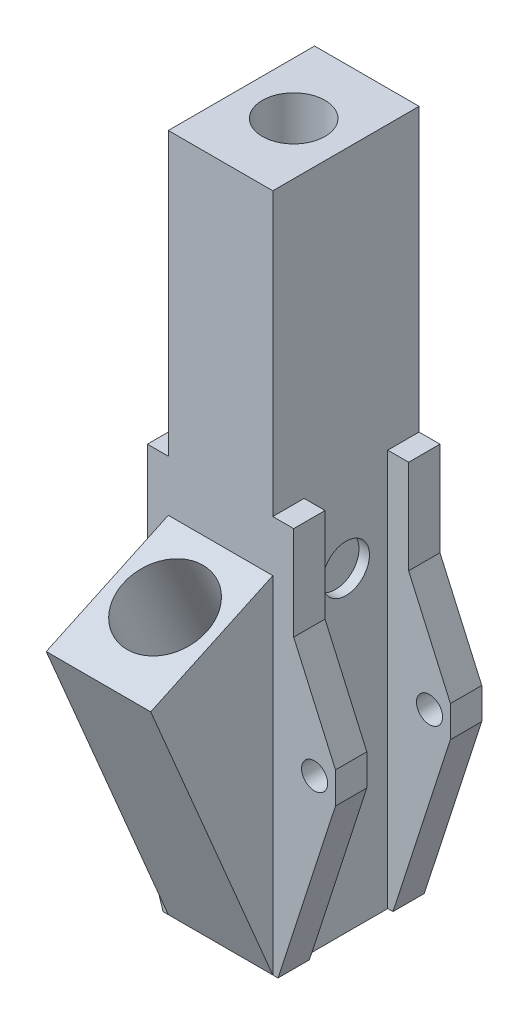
ISO-10303-21;
HEADER;
FILE_DESCRIPTION(('STEP AP214'),'2;1');
FILE_NAME('part.step','',(''),(''),'','','');
FILE_SCHEMA(('AUTOMOTIVE_DESIGN { 1 0 10303 214 1 1 1 1 }'));
ENDSEC;
DATA;
#1=APPLICATION_CONTEXT('core data for automotive mechanical design processes');
#2=APPLICATION_PROTOCOL_DEFINITION('international standard','automotive_design',2000,#1);
#3=PRODUCT_CONTEXT('',#1,'mechanical');
#4=PRODUCT('Part','Part','',(#3));
#5=PRODUCT_RELATED_PRODUCT_CATEGORY('part','',(#4));
#6=PRODUCT_DEFINITION_FORMATION('','',#4);
#7=PRODUCT_DEFINITION_CONTEXT('part definition',#1,'design');
#8=PRODUCT_DEFINITION('design','',#6,#7);
#9=PRODUCT_DEFINITION_SHAPE('','',#8);
#10=(LENGTH_UNIT() NAMED_UNIT(*) SI_UNIT(.MILLI.,.METRE.));
#11=(NAMED_UNIT(*) PLANE_ANGLE_UNIT() SI_UNIT($,.RADIAN.));
#12=(NAMED_UNIT(*) SI_UNIT($,.STERADIAN.) SOLID_ANGLE_UNIT());
#13=UNCERTAINTY_MEASURE_WITH_UNIT(LENGTH_MEASURE(1.E-05),#10,'distance_accuracy_value','');
#14=(GEOMETRIC_REPRESENTATION_CONTEXT(3) GLOBAL_UNCERTAINTY_ASSIGNED_CONTEXT((#13)) GLOBAL_UNIT_ASSIGNED_CONTEXT((#10,
#11,#12)) REPRESENTATION_CONTEXT('',''));
#15=CARTESIAN_POINT('',(0.,0.,0.));
#16=DIRECTION('',(0.,0.,1.));
#17=DIRECTION('',(1.,0.,0.));
#18=AXIS2_PLACEMENT_3D('',#15,#16,#17);
#19=CARTESIAN_POINT('',(1241.84071877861,488.798224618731,14.5844263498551));
#20=DIRECTION('',(0.,0.906307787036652,0.422618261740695));
#21=DIRECTION('',(0.,-0.422618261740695,0.906307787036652));
#22=AXIS2_PLACEMENT_3D('',#19,#20,#21);
#23=PLANE('',#22);
#24=CARTESIAN_POINT('',(1241.84071877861,487.107751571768,18.2096574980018));
#25=CARTESIAN_POINT('',(1242.60342541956,487.107751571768,18.2096574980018));
#26=CARTESIAN_POINT('',(1243.31309761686,487.226442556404,17.9551238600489));
#27=CARTESIAN_POINT('',(1243.68967365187,487.289424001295,17.820059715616));
#28=CARTESIAN_POINT('',(1244.02955779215,487.383306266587,17.6187285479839));
#29=CARTESIAN_POINT('',(1244.37583448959,487.478954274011,17.4136107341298));
#30=CARTESIAN_POINT('',(1244.66914590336,487.602879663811,17.1478518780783));
#31=CARTESIAN_POINT('',(1244.96169977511,487.726484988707,16.8827794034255));
#32=CARTESIAN_POINT('',(1245.18870082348,487.873181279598,16.5681881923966));
#33=CARTESIAN_POINT('',(1245.41036161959,488.016426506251,16.2609978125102));
#34=CARTESIAN_POINT('',(1245.55987198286,488.175970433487,15.9188547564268));
#35=CARTESIAN_POINT('',(1245.84061754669,488.475556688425,15.2763899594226));
#36=CARTESIAN_POINT('',(1245.84071877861,488.798224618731,14.5844263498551));
#37=CARTESIAN_POINT('',(1245.84081987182,489.120450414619,13.8934109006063));
#38=CARTESIAN_POINT('',(1245.55987198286,489.420478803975,13.2499979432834));
#39=CARTESIAN_POINT('',(1245.41084518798,489.579626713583,12.9087041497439));
#40=CARTESIAN_POINT('',(1245.18870082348,489.723267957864,12.6006645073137));
#41=CARTESIAN_POINT('',(1244.96237835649,489.869610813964,12.2868312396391));
#42=CARTESIAN_POINT('',(1244.66914590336,489.993569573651,12.0210008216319));
#43=CARTESIAN_POINT('',(1244.37667078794,490.117208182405,11.7558569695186));
#44=CARTESIAN_POINT('',(1244.02955779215,490.213142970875,11.5501241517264));
#45=CARTESIAN_POINT('',(1243.69061070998,490.30682087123,11.3492312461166));
#46=CARTESIAN_POINT('',(1243.31309761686,490.370006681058,11.2137288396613));
#47=CARTESIAN_POINT('',(1242.60396053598,490.488697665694,10.9591952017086));
#48=CARTESIAN_POINT('',(1241.84071877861,490.488697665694,10.9591952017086));
#49=B_SPLINE_CURVE_WITH_KNOTS('',2,(#24,#25,#26,#27,#28,#29,#30,#31,#32,#33,#34,#35,#36,#37,#38,
#39,#40,#41,#42,#43,#44,#45,#46,#47,#48),.UNSPECIFIED.,.F.,.F.,(3,2,2,2,2,2,2,2,2,2,2,2,3),(0.,
0.125,0.1875,0.25,0.3125,0.375,0.5,0.625,0.6875,0.75,0.8125,0.875,1.),.UNSPECIFIED.);
#50=CARTESIAN_POINT('',(1241.84071877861,487.107751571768,18.2096574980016));
#51=VERTEX_POINT('',#50);
#52=CARTESIAN_POINT('',(1241.84071877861,490.488697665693,10.9591952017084));
#53=VERTEX_POINT('',#52);
#54=EDGE_CURVE('E272',#51,#53,#49,.T.);
#55=ORIENTED_EDGE('',*,*,#54,.T.);
#56=CARTESIAN_POINT('',(1241.84071877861,490.488697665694,10.9591952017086));
#57=CARTESIAN_POINT('',(1241.07801213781,490.488697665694,10.9591952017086));
#58=CARTESIAN_POINT('',(1240.36833994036,490.370006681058,11.2137288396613));
#59=CARTESIAN_POINT('',(1239.99176390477,490.307025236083,11.3487929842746));
#60=CARTESIAN_POINT('',(1239.65187976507,490.213142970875,11.5501241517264));
#61=CARTESIAN_POINT('',(1239.30560306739,490.117494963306,11.7552419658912));
#62=CARTESIAN_POINT('',(1239.01229165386,489.993569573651,12.0210008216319));
#63=CARTESIAN_POINT('',(1238.71973778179,489.869964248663,12.2860732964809));
#64=CARTESIAN_POINT('',(1238.49273673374,489.723267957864,12.6006645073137));
#65=CARTESIAN_POINT('',(1238.27107593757,489.580022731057,12.9078548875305));
#66=CARTESIAN_POINT('',(1238.12156557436,489.420478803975,13.2499979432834));
#67=CARTESIAN_POINT('',(1237.84082001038,489.120892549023,13.8924627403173));
#68=CARTESIAN_POINT('',(1237.84071877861,488.798224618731,14.5844263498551));
#69=CARTESIAN_POINT('',(1237.84061768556,488.475998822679,15.2754417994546));
#70=CARTESIAN_POINT('',(1238.12156557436,488.175970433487,15.9188547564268));
#71=CARTESIAN_POINT('',(1238.27059236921,488.0168225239,16.2601485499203));
#72=CARTESIAN_POINT('',(1238.49273673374,487.873181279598,16.5681881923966));
#73=CARTESIAN_POINT('',(1238.7190592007,487.726838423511,16.8820214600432));
#74=CARTESIAN_POINT('',(1239.01229165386,487.602879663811,17.1478518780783));
#75=CARTESIAN_POINT('',(1239.30476676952,487.479241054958,17.4129957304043));
#76=CARTESIAN_POINT('',(1239.65187976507,487.383306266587,17.6187285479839));
#77=CARTESIAN_POINT('',(1239.99082684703,487.289628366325,17.8196214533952));
#78=CARTESIAN_POINT('',(1240.36833994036,487.226442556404,17.955123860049));
#79=CARTESIAN_POINT('',(1241.0774770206,487.107751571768,18.2096574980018));
#80=CARTESIAN_POINT('',(1241.84071877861,487.107751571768,18.2096574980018));
#81=B_SPLINE_CURVE_WITH_KNOTS('',2,(#56,#57,#58,#59,#60,#61,#62,#63,#64,#65,#66,#67,#68,#69,#70,
#71,#72,#73,#74,#75,#76,#77,#78,#79,#80),.UNSPECIFIED.,.F.,.F.,(3,2,2,2,2,2,2,2,2,2,2,2,3),(0.,
0.125,0.1875,0.25,0.3125,0.375,0.5,0.625,0.6875,0.75,0.8125,0.875,1.),.UNSPECIFIED.);
#82=EDGE_CURVE('E275',#53,#51,#81,.T.);
#83=ORIENTED_EDGE('',*,*,#82,.T.);
#84=EDGE_LOOP('',(#55,#83));
#85=FACE_BOUND('',#84,.T.);
#86=CARTESIAN_POINT('',(1241.84071877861,487.530369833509,17.3033497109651));
#87=CARTESIAN_POINT('',(1241.26875573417,487.530369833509,17.3033497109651));
#88=CARTESIAN_POINT('',(1240.73643464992,487.619388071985,17.1124494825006));
#89=CARTESIAN_POINT('',(1240.15918976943,487.715918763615,16.9054387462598));
#90=CARTESIAN_POINT('',(1239.71939843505,487.901715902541,16.5069954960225));
#91=CARTESIAN_POINT('',(1239.28035242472,488.087198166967,16.1092274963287));
#92=CARTESIAN_POINT('',(1239.05135387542,488.331533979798,15.5852476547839));
#93=CARTESIAN_POINT('',(1238.8408200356,488.55616840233,15.1035175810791));
#94=CARTESIAN_POINT('',(1238.84071877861,488.798224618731,14.5844263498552));
#95=CARTESIAN_POINT('',(1238.84061770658,489.039838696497,14.0662832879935));
#96=CARTESIAN_POINT('',(1239.05135387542,489.264915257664,13.5836050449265));
#97=CARTESIAN_POINT('',(1239.27976495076,489.508869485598,13.060443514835));
#98=CARTESIAN_POINT('',(1239.71939843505,489.694733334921,12.6618572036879));
#99=CARTESIAN_POINT('',(1240.15828686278,489.880282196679,12.2639463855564));
#100=CARTESIAN_POINT('',(1240.73643464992,489.977061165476,12.0564032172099));
#101=CARTESIAN_POINT('',(1241.26822061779,490.066079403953,11.8655029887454));
#102=CARTESIAN_POINT('',(1241.84071877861,490.066079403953,11.8655029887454));
#103=B_SPLINE_CURVE_WITH_KNOTS('',2,(#86,#87,#88,#89,#90,#91,#92,#93,#94,#95,#96,#97,#98,#99,
#100,#101,#102),.UNSPECIFIED.,.F.,.F.,(3,2,2,2,2,2,2,2,3),(0.,0.125,0.25,0.375,0.5,0.625,0.75,
0.875,1.),.UNSPECIFIED.);
#104=CARTESIAN_POINT('',(1241.84071877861,487.530369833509,17.3033497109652));
#105=VERTEX_POINT('',#104);
#106=CARTESIAN_POINT('',(1241.84071877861,490.066079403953,11.8655029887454));
#107=VERTEX_POINT('',#106);
#108=EDGE_CURVE('E280',#105,#107,#103,.T.);
#109=ORIENTED_EDGE('',*,*,#108,.T.);
#110=CARTESIAN_POINT('',(1241.84071877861,490.066079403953,11.8655029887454));
#111=CARTESIAN_POINT('',(1242.41268182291,490.066079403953,11.8655029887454));
#112=CARTESIAN_POINT('',(1242.9450029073,489.977061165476,12.0564032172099));
#113=CARTESIAN_POINT('',(1243.52224778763,489.880530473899,12.2634139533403));
#114=CARTESIAN_POINT('',(1243.96203912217,489.694733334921,12.6618572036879));
#115=CARTESIAN_POINT('',(1244.40108513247,489.509251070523,13.0596252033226));
#116=CARTESIAN_POINT('',(1244.6300836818,489.264915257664,13.5836050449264));
#117=CARTESIAN_POINT('',(1244.84061752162,489.040280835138,14.0653351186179));
#118=CARTESIAN_POINT('',(1244.84071877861,488.798224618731,14.5844263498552));
#119=CARTESIAN_POINT('',(1244.84081985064,488.556610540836,15.1025694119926));
#120=CARTESIAN_POINT('',(1244.6300836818,488.331533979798,15.5852476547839));
#121=CARTESIAN_POINT('',(1244.40167260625,488.087579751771,16.1084091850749));
#122=CARTESIAN_POINT('',(1243.96203912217,487.901715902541,16.5069954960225));
#123=CARTESIAN_POINT('',(1243.52315069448,487.716167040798,16.9049063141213));
#124=CARTESIAN_POINT('',(1242.9450029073,487.619388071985,17.1124494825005));
#125=CARTESIAN_POINT('',(1242.41321693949,487.530369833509,17.3033497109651));
#126=CARTESIAN_POINT('',(1241.84071877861,487.530369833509,17.3033497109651));
#127=B_SPLINE_CURVE_WITH_KNOTS('',2,(#110,#111,#112,#113,#114,#115,#116,#117,#118,#119,#120,
#121,#122,#123,#124,#125,#126),.UNSPECIFIED.,.F.,.F.,(3,2,2,2,2,2,2,2,3),(0.,0.125,0.25,0.375,
0.5,0.625,0.75,0.875,1.),.UNSPECIFIED.);
#128=EDGE_CURVE('E531',#107,#105,#127,.T.);
#129=ORIENTED_EDGE('',*,*,#128,.T.);
#130=EDGE_LOOP('',(#109,#129));
#131=FACE_BOUND('',#130,.T.);
#132=ADVANCED_FACE('F16',(#85,#131),#23,.T.);
#133=CARTESIAN_POINT('',(1241.84071877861,488.798224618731,14.5844263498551));
#134=DIRECTION('',(0.,0.906307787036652,0.422618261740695));
#135=DIRECTION('',(0.,-0.422618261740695,0.906307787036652));
#136=AXIS2_PLACEMENT_3D('',#133,#134,#135);
#137=CYLINDRICAL_SURFACE('',#136,4.);
#138=ORIENTED_EDGE('',*,*,#82,.F.);
#139=ORIENTED_EDGE('',*,*,#54,.F.);
#140=EDGE_LOOP('',(#138,#139));
#141=FACE_BOUND('',#140,.T.);
#142=CARTESIAN_POINT('',(1241.84071877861,498.9357623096,19.311637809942));
#143=DIRECTION('',(0.,0.906307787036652,0.422618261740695));
#144=DIRECTION('',(0.,0.422618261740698,-0.90630778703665));
#145=AXIS2_PLACEMENT_3D('',#142,#143,#144);
#146=CIRCLE('',#145,4.);
#147=CARTESIAN_POINT('',(1241.84071877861,500.626235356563,15.6864066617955));
#148=VERTEX_POINT('',#147);
#149=CARTESIAN_POINT('',(1241.84071877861,497.245289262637,22.9368689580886));
#150=VERTEX_POINT('',#149);
#151=EDGE_CURVE('E488',#148,#150,#146,.T.);
#152=ORIENTED_EDGE('',*,*,#151,.T.);
#153=CARTESIAN_POINT('',(1241.84071877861,498.935762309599,19.3116378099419));
#154=DIRECTION('',(0.,0.906307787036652,0.422618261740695));
#155=DIRECTION('',(0.,-0.422618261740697,0.906307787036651));
#156=AXIS2_PLACEMENT_3D('',#153,#154,#155);
#157=CIRCLE('',#156,4.00000000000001);
#158=EDGE_CURVE('E490',#150,#148,#157,.T.);
#159=ORIENTED_EDGE('',*,*,#158,.T.);
#160=EDGE_LOOP('',(#152,#159));
#161=FACE_BOUND('',#160,.T.);
#162=ADVANCED_FACE('F283',(#141,#161),#137,.F.);
#163=CARTESIAN_POINT('',(1245.8407187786,498.511282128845,7.));
#164=DIRECTION('',(1.,0.,0.));
#165=DIRECTION('',(0.,0.,-1.));
#166=AXIS2_PLACEMENT_3D('',#163,#164,#165);
#167=PLANE('',#166);
#168=CARTESIAN_POINT('',(1245.8407187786,498.511282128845,9.25));
#169=CARTESIAN_POINT('',(1245.8407187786,498.082376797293,9.25));
#170=CARTESIAN_POINT('',(1245.8407187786,497.683069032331,9.09202367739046));
#171=CARTESIAN_POINT('',(1245.8407187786,497.250248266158,8.92078875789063));
#172=CARTESIAN_POINT('',(1245.8407187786,496.920291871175,8.59099025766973));
#173=CARTESIAN_POINT('',(1245.8407187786,496.591080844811,8.26193676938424));
#174=CARTESIAN_POINT('',(1245.8407187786,496.419258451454,7.82821309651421));
#175=CARTESIAN_POINT('',(1245.8407187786,496.261383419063,7.42969613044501));
#176=CARTESIAN_POINT('',(1245.8407187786,496.261282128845,7.));
#177=CARTESIAN_POINT('',(1245.8407187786,496.261181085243,6.57135007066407));
#178=CARTESIAN_POINT('',(1245.8407187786,496.419258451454,6.17178690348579));
#179=CARTESIAN_POINT('',(1245.8407187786,496.59049337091,5.73896613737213));
#180=CARTESIAN_POINT('',(1245.8407187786,496.920291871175,5.40900974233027));
#181=CARTESIAN_POINT('',(1245.8407187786,497.249345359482,5.07979871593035));
#182=CARTESIAN_POINT('',(1245.8407187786,497.683069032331,4.90797632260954));
#183=CARTESIAN_POINT('',(1245.8407187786,498.081841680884,4.75));
#184=CARTESIAN_POINT('',(1245.8407187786,498.511282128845,4.75));
#185=B_SPLINE_CURVE_WITH_KNOTS('',2,(#168,#169,#170,#171,#172,#173,#174,#175,#176,#177,#178,
#179,#180,#181,#182,#183,#184),.UNSPECIFIED.,.F.,.F.,(3,2,2,2,2,2,2,2,3),(0.,0.125,0.25,0.375,
0.5,0.625,0.75,0.875,1.),.UNSPECIFIED.);
#186=CARTESIAN_POINT('',(1245.8407187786,498.511282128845,9.25));
#187=VERTEX_POINT('',#186);
#188=CARTESIAN_POINT('',(1245.8407187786,498.511282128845,4.75));
#189=VERTEX_POINT('',#188);
#190=EDGE_CURVE('E882',#187,#189,#185,.T.);
#191=ORIENTED_EDGE('',*,*,#190,.T.);
#192=CARTESIAN_POINT('',(1245.8407187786,498.511282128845,4.75));
#193=CARTESIAN_POINT('',(1245.8407187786,498.940187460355,4.75));
#194=CARTESIAN_POINT('',(1245.8407187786,499.339495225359,4.90797632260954));
#195=CARTESIAN_POINT('',(1245.8407187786,499.772315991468,5.07921124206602));
#196=CARTESIAN_POINT('',(1245.8407187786,500.102272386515,5.40900974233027));
#197=CARTESIAN_POINT('',(1245.8407187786,500.43148341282,5.73806323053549));
#198=CARTESIAN_POINT('',(1245.8407187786,500.603305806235,6.17178690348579));
#199=CARTESIAN_POINT('',(1245.8407187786,500.761180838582,6.57030386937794));
#200=CARTESIAN_POINT('',(1245.8407187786,500.761282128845,7.));
#201=CARTESIAN_POINT('',(1245.8407187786,500.761383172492,7.42864992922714));
#202=CARTESIAN_POINT('',(1245.8407187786,500.603305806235,7.82821309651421));
#203=CARTESIAN_POINT('',(1245.8407187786,500.432070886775,8.26103386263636));
#204=CARTESIAN_POINT('',(1245.8407187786,500.102272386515,8.59099025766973));
#205=CARTESIAN_POINT('',(1245.8407187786,499.773218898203,8.92020128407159));
#206=CARTESIAN_POINT('',(1245.8407187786,499.339495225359,9.09202367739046));
#207=CARTESIAN_POINT('',(1245.8407187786,498.940722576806,9.25));
#208=CARTESIAN_POINT('',(1245.8407187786,498.511282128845,9.25));
#209=B_SPLINE_CURVE_WITH_KNOTS('',2,(#192,#193,#194,#195,#196,#197,#198,#199,#200,#201,#202,
#203,#204,#205,#206,#207,#208),.UNSPECIFIED.,.F.,.F.,(3,2,2,2,2,2,2,2,3),(0.,0.125,0.25,0.375,
0.5,0.625,0.75,0.875,1.),.UNSPECIFIED.);
#210=EDGE_CURVE('E454',#189,#187,#209,.T.);
#211=ORIENTED_EDGE('',*,*,#210,.T.);
#212=EDGE_LOOP('',(#191,#211));
#213=FACE_BOUND('',#212,.T.);
#214=ADVANCED_FACE('F298',(#213),#167,.T.);
#215=CARTESIAN_POINT('',(1241.84071877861,472.484684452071,6.97729763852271));
#216=DIRECTION('',(0.,0.906307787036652,0.422618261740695));
#217=DIRECTION('',(0.,-0.422618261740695,0.906307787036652));
#218=AXIS2_PLACEMENT_3D('',#215,#216,#217);
#219=CYLINDRICAL_SURFACE('',#218,2.99999999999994);
#220=CARTESIAN_POINT('',(1241.84071877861,472.484684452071,6.97729763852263));
#221=DIRECTION('',(0.,-0.906307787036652,-0.422618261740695));
#222=DIRECTION('',(-0.999992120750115,-0.0016776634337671,0.00359776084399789));
#223=AXIS2_PLACEMENT_3D('',#220,#221,#222);
#224=CIRCLE('',#223,3.00000000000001);
#225=CARTESIAN_POINT('',(1238.84074241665,472.479651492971,6.98809085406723));
#226=VERTEX_POINT('',#225);
#227=CARTESIAN_POINT('',(1238.85052022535,472.587087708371,6.75769314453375));
#228=VERTEX_POINT('',#227);
#229=EDGE_CURVE('E1436',#226,#228,#224,.T.);
#230=ORIENTED_EDGE('',*,*,#229,.T.);
#231=CARTESIAN_POINT('',(1238.85052030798,472.587088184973,6.75769212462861));
#232=CARTESIAN_POINT('',(1238.84970395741,472.584859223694,6.76776833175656));
#233=CARTESIAN_POINT('',(1238.84893852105,472.582628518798,6.77784827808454));
#234=CARTESIAN_POINT('',(1238.8475095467,472.578164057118,6.79801471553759));
#235=CARTESIAN_POINT('',(1238.84684600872,472.575930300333,6.80810120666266));
#236=CARTESIAN_POINT('',(1238.84562090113,472.57146017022,6.82827980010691));
#237=CARTESIAN_POINT('',(1238.84505933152,472.569223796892,6.83837190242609));
#238=CARTESIAN_POINT('',(1238.84403821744,472.564748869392,6.85856078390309));
#239=CARTESIAN_POINT('',(1238.84357867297,472.562510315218,6.86865756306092));
#240=CARTESIAN_POINT('',(1238.8427616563,472.558031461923,6.8888548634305));
#241=CARTESIAN_POINT('',(1238.84240418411,472.555791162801,6.89895538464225));
#242=CARTESIAN_POINT('',(1238.84179134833,472.551309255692,6.91915923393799));
#243=CARTESIAN_POINT('',(1238.84153598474,472.549067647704,6.92926256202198));
#244=CARTESIAN_POINT('',(1238.84112739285,472.544583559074,6.94947108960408));
#245=CARTESIAN_POINT('',(1238.84097416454,472.542341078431,6.95957628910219));
#246=CARTESIAN_POINT('',(1238.84076985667,472.537855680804,6.97978762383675));
#247=CARTESIAN_POINT('',(1238.84071877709,472.53561276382,6.9898937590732));
#248=CARTESIAN_POINT('',(1238.84071877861,472.533369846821,6.99999989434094));
#249=B_SPLINE_CURVE_WITH_KNOTS('',3,(#231,#232,#233,#234,#235,#236,#237,#238,#239,#240,#241,
#242,#243,#244,#245,#246,#247,#248),.UNSPECIFIED.,.F.,.F.,(4,2,2,2,2,2,2,2,4),(0.,
0.0310559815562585,0.0621119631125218,0.0931679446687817,0.124223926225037,0.15527990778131,
0.186335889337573,0.217391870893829,0.248447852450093),.UNSPECIFIED.);
#250=CARTESIAN_POINT('',(1238.84071877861,472.533369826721,6.99999998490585));
#251=VERTEX_POINT('',#250);
#252=EDGE_CURVE('E584',#228,#251,#249,.T.);
#253=ORIENTED_EDGE('',*,*,#252,.T.);
#254=CARTESIAN_POINT('',(1238.84071877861,472.533369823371,7.));
#255=CARTESIAN_POINT('',(1238.84071877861,472.531131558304,6.99950378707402));
#256=CARTESIAN_POINT('',(1238.84071890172,472.528893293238,6.99900757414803));
#257=CARTESIAN_POINT('',(1238.84071939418,472.524416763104,6.99801514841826));
#258=CARTESIAN_POINT('',(1238.84071976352,472.522178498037,6.99751893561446));
#259=CARTESIAN_POINT('',(1238.84072074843,472.517701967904,6.99652651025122));
#260=CARTESIAN_POINT('',(1238.840721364,472.515463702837,6.99603029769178));
#261=CARTESIAN_POINT('',(1238.84072284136,472.510987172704,6.99503787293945));
#262=CARTESIAN_POINT('',(1238.84072370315,472.508748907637,6.99454166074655));
#263=CARTESIAN_POINT('',(1238.84072567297,472.504272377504,6.99354923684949));
#264=CARTESIAN_POINT('',(1238.84072678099,472.502034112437,6.99305302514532));
#265=CARTESIAN_POINT('',(1238.84072924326,472.497557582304,6.99206060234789));
#266=CARTESIAN_POINT('',(1238.84073059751,472.495319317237,6.99156439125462));
#267=CARTESIAN_POINT('',(1238.84073355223,472.490842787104,6.99057196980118));
#268=CARTESIAN_POINT('',(1238.84073515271,472.488604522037,6.990075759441));
#269=CARTESIAN_POINT('',(1238.84073859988,472.484127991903,6.9890833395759));
#270=CARTESIAN_POINT('',(1238.84074044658,472.481889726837,6.98858713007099));
#271=CARTESIAN_POINT('',(1238.8407424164,472.47965146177,6.9880909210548));
#272=B_SPLINE_CURVE_WITH_KNOTS('',3,(#254,#255,#256,#257,#258,#259,#260,#261,#262,#263,#264,
#265,#266,#267,#268,#269,#270,#271),.UNSPECIFIED.,.F.,.F.,(4,2,2,2,2,2,2,2,4),(0.,
0.00687782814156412,0.0137556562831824,0.0206334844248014,0.0275113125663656,0.0343891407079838,
0.0412669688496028,0.0481447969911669,0.0550226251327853),.UNSPECIFIED.);
#273=EDGE_CURVE('E1430',#251,#226,#272,.T.);
#274=ORIENTED_EDGE('',*,*,#273,.T.);
#275=EDGE_LOOP('',(#230,#253,#274));
#276=FACE_BOUND('',#275,.T.);
#277=ADVANCED_FACE('F1296',(#276),#219,.F.);
#278=CARTESIAN_POINT('',(1241.84071877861,472.484684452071,6.97729763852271));
#279=DIRECTION('',(0.,0.906307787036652,0.422618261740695));
#280=DIRECTION('',(0.,-0.422618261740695,0.906307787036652));
#281=AXIS2_PLACEMENT_3D('',#278,#279,#280);
#282=CYLINDRICAL_SURFACE('',#281,2.99999999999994);
#283=CARTESIAN_POINT('',(1244.84069514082,472.47965146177,6.98809092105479));
#284=CARTESIAN_POINT('',(1244.84069711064,472.481889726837,6.98858713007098));
#285=CARTESIAN_POINT('',(1244.84069895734,472.484127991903,6.98908333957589));
#286=CARTESIAN_POINT('',(1244.84070240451,472.488604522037,6.99007575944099));
#287=CARTESIAN_POINT('',(1244.84070400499,472.490842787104,6.99057196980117));
#288=CARTESIAN_POINT('',(1244.84070695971,472.495319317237,6.99156439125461));
#289=CARTESIAN_POINT('',(1244.84070831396,472.497557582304,6.99206060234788));
#290=CARTESIAN_POINT('',(1244.84071077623,472.502034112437,6.99305302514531));
#291=CARTESIAN_POINT('',(1244.84071188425,472.504272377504,6.99354923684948));
#292=CARTESIAN_POINT('',(1244.84071385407,472.508748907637,6.99454166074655));
#293=CARTESIAN_POINT('',(1244.84071471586,472.510987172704,6.99503787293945));
#294=CARTESIAN_POINT('',(1244.84071619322,472.515463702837,6.99603029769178));
#295=CARTESIAN_POINT('',(1244.84071680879,472.517701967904,6.99652651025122));
#296=CARTESIAN_POINT('',(1244.8407177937,472.522178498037,6.99751893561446));
#297=CARTESIAN_POINT('',(1244.84071816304,472.524416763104,6.99801514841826));
#298=CARTESIAN_POINT('',(1244.8407186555,472.528893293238,6.99900757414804));
#299=CARTESIAN_POINT('',(1244.84071877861,472.531131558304,6.99950378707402));
#300=CARTESIAN_POINT('',(1244.84071877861,472.533369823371,7.00000000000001));
#301=B_SPLINE_CURVE_WITH_KNOTS('',3,(#283,#284,#285,#286,#287,#288,#289,#290,#291,#292,#293,
#294,#295,#296,#297,#298,#299,#300),.UNSPECIFIED.,.F.,.F.,(4,2,2,2,2,2,2,2,4),(0.,
0.00687782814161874,0.0137556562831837,0.0206334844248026,0.0275113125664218,0.0343891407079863,
0.0412669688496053,0.0481447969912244,0.0550226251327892),.UNSPECIFIED.);
#302=CARTESIAN_POINT('',(1244.84069514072,472.479651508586,6.98809082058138));
#303=VERTEX_POINT('',#302);
#304=CARTESIAN_POINT('',(1244.84071877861,472.533369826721,6.99999998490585));
#305=VERTEX_POINT('',#304);
#306=EDGE_CURVE('E371',#303,#305,#301,.T.);
#307=ORIENTED_EDGE('',*,*,#306,.T.);
#308=CARTESIAN_POINT('',(1244.84071877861,472.533369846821,6.99999989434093));
#309=CARTESIAN_POINT('',(1244.84071878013,472.53561276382,6.98989375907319));
#310=CARTESIAN_POINT('',(1244.84066770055,472.537855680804,6.97978762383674));
#311=CARTESIAN_POINT('',(1244.84046339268,472.542341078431,6.95957628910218));
#312=CARTESIAN_POINT('',(1244.84031016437,472.544583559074,6.94947108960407));
#313=CARTESIAN_POINT('',(1244.83990157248,472.549067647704,6.92926256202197));
#314=CARTESIAN_POINT('',(1244.83964620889,472.551309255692,6.91915923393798));
#315=CARTESIAN_POINT('',(1244.83903337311,472.555791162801,6.89895538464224));
#316=CARTESIAN_POINT('',(1244.83867590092,472.558031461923,6.88885486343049));
#317=CARTESIAN_POINT('',(1244.83785888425,472.562510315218,6.86865756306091));
#318=CARTESIAN_POINT('',(1244.83739933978,472.564748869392,6.85856078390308));
#319=CARTESIAN_POINT('',(1244.8363782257,472.569223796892,6.83837190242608));
#320=CARTESIAN_POINT('',(1244.83581665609,472.57146017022,6.8282798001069));
#321=CARTESIAN_POINT('',(1244.8345915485,472.575930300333,6.80810120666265));
#322=CARTESIAN_POINT('',(1244.83392801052,472.578164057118,6.79801471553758));
#323=CARTESIAN_POINT('',(1244.83249903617,472.582628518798,6.77784827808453));
#324=CARTESIAN_POINT('',(1244.83173359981,472.584859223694,6.76776833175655));
#325=CARTESIAN_POINT('',(1244.83091724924,472.587088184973,6.7576921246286));
#326=B_SPLINE_CURVE_WITH_KNOTS('',3,(#308,#309,#310,#311,#312,#313,#314,#315,#316,#317,#318,
#319,#320,#321,#322,#323,#324,#325),.UNSPECIFIED.,.F.,.F.,(4,2,2,2,2,2,2,2,4),(0.,
0.0310559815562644,0.0621119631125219,0.0931679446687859,0.124223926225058,0.155279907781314,
0.186335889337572,0.217391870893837,0.248447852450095),.UNSPECIFIED.);
#327=CARTESIAN_POINT('',(1244.83091733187,472.587087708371,6.7576931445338));
#328=VERTEX_POINT('',#327);
#329=EDGE_CURVE('E587',#305,#328,#326,.T.);
#330=ORIENTED_EDGE('',*,*,#329,.T.);
#331=CARTESIAN_POINT('',(1241.84071877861,472.484684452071,6.97729763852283));
#332=DIRECTION('',(0.,-0.906307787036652,-0.422618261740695));
#333=DIRECTION('',(0.996732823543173,0.034134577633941,-0.07320183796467));
#334=AXIS2_PLACEMENT_3D('',#331,#332,#333);
#335=CIRCLE('',#334,3.00000000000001);
#336=EDGE_CURVE('E1424',#328,#303,#335,.T.);
#337=ORIENTED_EDGE('',*,*,#336,.T.);
#338=EDGE_LOOP('',(#307,#330,#337));
#339=FACE_BOUND('',#338,.T.);
#340=ADVANCED_FACE('F551',(#339),#282,.F.);
#341=CARTESIAN_POINT('',(1241.84071877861,472.484684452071,6.97729763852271));
#342=DIRECTION('',(0.,0.906307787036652,0.422618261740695));
#343=DIRECTION('',(0.,-0.422618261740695,0.906307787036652));
#344=AXIS2_PLACEMENT_3D('',#341,#342,#343);
#345=CYLINDRICAL_SURFACE('',#344,2.99999999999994);
#346=ORIENTED_EDGE('',*,*,#128,.F.);
#347=ORIENTED_EDGE('',*,*,#108,.F.);
#348=EDGE_LOOP('',(#346,#347));
#349=FACE_BOUND('',#348,.T.);
#350=CARTESIAN_POINT('',(1238.84071877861,472.533369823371,7.00000000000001));
#351=CARTESIAN_POINT('',(1238.84074408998,472.928729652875,7.08753775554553));
#352=CARTESIAN_POINT('',(1238.84456659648,473.324079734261,7.17513995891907));
#353=CARTESIAN_POINT('',(1238.85824242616,474.025376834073,7.33062296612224));
#354=CARTESIAN_POINT('',(1238.86653943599,474.331357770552,7.39849127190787));
#355=CARTESIAN_POINT('',(1238.88137376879,474.756753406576,7.49287737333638));
#356=CARTESIAN_POINT('',(1238.88590267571,474.876240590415,7.51939239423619));
#357=CARTESIAN_POINT('',(1238.89846259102,475.182487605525,7.58731020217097));
#358=CARTESIAN_POINT('',(1238.907029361,475.369231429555,7.6286866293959));
#359=CARTESIAN_POINT('',(1238.93407286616,475.90135626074,7.74660205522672));
#360=CARTESIAN_POINT('',(1238.9547828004,476.246629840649,7.8231288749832));
#361=CARTESIAN_POINT('',(1239.00027164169,476.899469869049,7.96790248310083));
#362=CARTESIAN_POINT('',(1239.02437002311,477.207083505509,8.03615137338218));
#363=CARTESIAN_POINT('',(1239.08331908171,477.878609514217,8.18499453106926));
#364=CARTESIAN_POINT('',(1239.11933343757,478.242431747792,8.26554196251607));
#365=CARTESIAN_POINT('',(1239.19722834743,478.941066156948,8.42019095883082));
#366=CARTESIAN_POINT('',(1239.23844097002,479.275948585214,8.49430987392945));
#367=CARTESIAN_POINT('',(1239.32568685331,479.91663321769,8.63623497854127));
#368=CARTESIAN_POINT('',(1239.3710293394,480.222526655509,8.70405103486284));
#369=CARTESIAN_POINT('',(1239.46556400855,480.805219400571,8.8333631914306));
#370=CARTESIAN_POINT('',(1239.51403010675,481.0821325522,8.89487268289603));
#371=CARTESIAN_POINT('',(1239.6139510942,481.606890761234,9.01143084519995));
#372=CARTESIAN_POINT('',(1239.66462397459,481.854876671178,9.0665112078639));
#373=CARTESIAN_POINT('',(1239.77681253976,482.361088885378,9.17877079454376));
#374=CARTESIAN_POINT('',(1239.83873306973,482.619232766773,9.23592324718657));
#375=CARTESIAN_POINT('',(1239.96699287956,483.106755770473,9.34386620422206));
#376=CARTESIAN_POINT('',(1240.03225184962,483.336403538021,9.39471552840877));
#377=CARTESIAN_POINT('',(1240.16665638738,483.766875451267,9.49009091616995));
#378=CARTESIAN_POINT('',(1240.23456030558,483.968062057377,9.53469067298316));
#379=CARTESIAN_POINT('',(1240.34244322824,484.25723973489,9.59885116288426));
#380=CARTESIAN_POINT('',(1240.37740919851,484.347019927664,9.61877870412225));
#381=CARTESIAN_POINT('',(1240.44798362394,484.519372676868,9.65704469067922));
#382=CARTESIAN_POINT('',(1240.48339038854,484.602023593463,9.67539980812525));
#383=CARTESIAN_POINT('',(1240.5547799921,484.760110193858,9.71050986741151));
#384=CARTESIAN_POINT('',(1240.59054201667,484.835640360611,9.72728563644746));
#385=CARTESIAN_POINT('',(1240.66259469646,484.979470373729,9.75921723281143));
#386=CARTESIAN_POINT('',(1240.6986416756,485.047885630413,9.77439975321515));
#387=CARTESIAN_POINT('',(1240.77060137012,485.176401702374,9.8028941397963));
#388=CARTESIAN_POINT('',(1240.80619510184,485.236670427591,9.81624571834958));
#389=CARTESIAN_POINT('',(1240.86109767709,485.323868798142,9.83555715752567));
#390=CARTESIAN_POINT('',(1240.87907978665,485.351596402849,9.84169694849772));
#391=CARTESIAN_POINT('',(1240.9151689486,485.405449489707,9.85362016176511));
#392=CARTESIAN_POINT('',(1240.93324396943,485.431595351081,9.85940815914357));
#393=CARTESIAN_POINT('',(1240.96951188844,485.482282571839,9.87062830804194));
#394=CARTESIAN_POINT('',(1240.9876717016,485.50684644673,9.87606546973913));
#395=CARTESIAN_POINT('',(1241.02410379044,485.554367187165,9.8865841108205));
#396=CARTESIAN_POINT('',(1241.0423419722,485.577348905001,9.89167109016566));
#397=CARTESIAN_POINT('',(1241.07892483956,485.621702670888,9.90148940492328));
#398=CARTESIAN_POINT('',(1241.09723461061,485.643102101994,9.90622677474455));
#399=CARTESIAN_POINT('',(1241.13395465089,485.684288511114,9.91534573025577));
#400=CARTESIAN_POINT('',(1241.15232942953,485.70410557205,9.91973392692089));
#401=CARTESIAN_POINT('',(1241.18917313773,485.742124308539,9.92815422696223));
#402=CARTESIAN_POINT('',(1241.20760634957,485.760358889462,9.93219354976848));
#403=CARTESIAN_POINT('',(1241.24456043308,485.795209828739,9.939915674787));
#404=CARTESIAN_POINT('',(1241.26304580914,485.811861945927,9.94360631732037));
#405=CARTESIAN_POINT('',(1241.3000965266,485.843544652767,9.95063041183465));
#406=CARTESIAN_POINT('',(1241.31862720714,485.858613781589,9.95397231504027));
#407=CARTESIAN_POINT('',(1241.35576276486,485.887129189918,9.96029856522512));
#408=CARTESIAN_POINT('',(1241.37433442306,485.900616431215,9.96329190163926));
#409=CARTESIAN_POINT('',(1241.40251095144,485.919812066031,9.96755396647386));
#410=CARTESIAN_POINT('',(1241.41181017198,485.925950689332,9.96891724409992));
#411=CARTESIAN_POINT('',(1241.43041946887,485.937826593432,9.97155527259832));
#412=CARTESIAN_POINT('',(1241.43972588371,485.943569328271,9.97283122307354));
#413=CARTESIAN_POINT('',(1241.45834821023,485.954653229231,9.97529450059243));
#414=CARTESIAN_POINT('',(1241.46766068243,485.959999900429,9.97648303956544));
#415=CARTESIAN_POINT('',(1241.48629414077,485.97029170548,9.97877144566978));
#416=CARTESIAN_POINT('',(1241.49561192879,485.975242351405,9.97987252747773));
#417=CARTESIAN_POINT('',(1241.51425490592,485.984742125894,9.98198596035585));
#418=CARTESIAN_POINT('',(1241.52357716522,485.989296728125,9.98299951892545));
#419=CARTESIAN_POINT('',(1241.54222797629,485.998004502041,9.98493785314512));
#420=CARTESIAN_POINT('',(1241.55155388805,486.002163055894,9.98586381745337));
#421=CARTESIAN_POINT('',(1241.57021086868,486.0100788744,9.98762691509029));
#422=CARTESIAN_POINT('',(1241.57953960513,486.013841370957,9.98846520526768));
#423=CARTESIAN_POINT('',(1241.59820108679,486.020965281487,9.99005291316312));
#424=CARTESIAN_POINT('',(1241.60753181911,486.024331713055,9.99080344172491));
#425=CARTESIAN_POINT('',(1241.62619613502,486.030663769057,9.99221559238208));
#426=CARTESIAN_POINT('',(1241.63552803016,486.033634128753,9.99287826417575));
#427=CARTESIAN_POINT('',(1241.65419351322,486.039174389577,9.99411467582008));
#428=CARTESIAN_POINT('',(1241.66352573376,486.041748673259,9.99468938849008));
#429=CARTESIAN_POINT('',(1241.68219071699,486.046497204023,9.99574986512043));
#430=CARTESIAN_POINT('',(1241.69152242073,486.048675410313,9.99623650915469));
#431=CARTESIAN_POINT('',(1241.71018523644,486.052632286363,9.99712084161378));
#432=CARTESIAN_POINT('',(1241.71951557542,486.054414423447,9.99751930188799));
#433=CARTESIAN_POINT('',(1241.73817455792,486.057579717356,9.99822726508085));
#434=CARTESIAN_POINT('',(1241.74750268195,486.058965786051,9.99853741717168));
#435=CARTESIAN_POINT('',(1241.76615615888,486.061339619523,9.99906878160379));
#436=CARTESIAN_POINT('',(1241.77548120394,486.062329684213,9.99929050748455));
#437=CARTESIAN_POINT('',(1241.79412753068,486.063912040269,9.9996449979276));
#438=CARTESIAN_POINT('',(1241.80344866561,486.064505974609,9.99977812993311));
#439=CARTESIAN_POINT('',(1241.82208610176,486.065297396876,9.99995557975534));
#440=CARTESIAN_POINT('',(1241.83140236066,486.065495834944,10.0000001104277));
#441=CARTESIAN_POINT('',(1241.84071877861,486.065495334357,9.99999999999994));
#442=B_SPLINE_CURVE_WITH_KNOTS('',3,(#350,#351,#352,#353,#354,#355,#356,#357,#358,#359,#360,
#361,#362,#363,#364,#365,#366,#367,#368,#369,#370,#371,#372,#373,#374,#375,#376,#377,#378,#379,
#380,#381,#382,#383,#384,#385,#386,#387,#388,#389,#390,#391,#392,#393,#394,#395,#396,#397,#398,
#399,#400,#401,#402,#403,#404,#405,#406,#407,#408,#409,#410,#411,#412,#413,#414,#415,#416,#417,
#418,#419,#420,#421,#422,#423,#424,#425,#426,#427,#428,#429,#430,#431,#432,#433,#434,#435,#436,
#437,#438,#439,#440,#441),.UNSPECIFIED.,.F.,.F.,(4,2,2,2,2,2,2,2,2,2,2,2,2,2,2,2,2,2,2,2,2,2,2,
2,2,2,2,2,2,2,2,2,2,2,2,2,2,2,2,2,2,2,2,2,2,4),(0.,1.21479250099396,2.15533778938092,
2.52276857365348,3.09715447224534,4.15986463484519,5.10786233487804,6.23086514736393,
7.26713076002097,8.21678793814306,9.0800042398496,9.85700318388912,10.6714466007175,
11.4035175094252,12.0540825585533,12.3492028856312,12.6244571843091,12.8800984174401,
13.1164425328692,13.3301093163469,13.4309380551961,13.527847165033,13.6209141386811,
13.7102264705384,13.7958831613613,13.8779964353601,13.9566936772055,14.0321195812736,
14.1044384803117,14.1738367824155,14.2075094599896,14.2405333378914,14.2729389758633,
14.3047587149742,14.3360267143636,14.3667789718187,14.3970533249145,14.4268894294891,
14.4563287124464,14.4854142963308,14.5141908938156,14.5427046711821,14.5710030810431,
14.5991346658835,14.6271488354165,14.6550956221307),.UNSPECIFIED.);
#443=CARTESIAN_POINT('',(1241.84071877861,486.065495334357,10.));
#444=VERTEX_POINT('',#443);
#445=EDGE_CURVE('E379',#251,#444,#442,.T.);
#446=ORIENTED_EDGE('',*,*,#445,.T.);
#447=CARTESIAN_POINT('',(1241.84071877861,486.065495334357,9.99999999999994));
#448=CARTESIAN_POINT('',(1241.85003534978,486.065495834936,10.0000001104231));
#449=CARTESIAN_POINT('',(1241.85935176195,486.06529739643,9.99995558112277));
#450=CARTESIAN_POINT('',(1241.87798949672,486.064505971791,9.99977813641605));
#451=CARTESIAN_POINT('',(1241.88731077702,486.063912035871,9.9996450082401));
#452=CARTESIAN_POINT('',(1241.90595738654,486.062329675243,9.99929052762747));
#453=CARTESIAN_POINT('',(1241.91528256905,486.061339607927,9.99906880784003));
#454=CARTESIAN_POINT('',(1241.93393631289,486.058965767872,9.99853745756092));
#455=CARTESIAN_POINT('',(1241.94326456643,486.057579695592,9.99822731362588));
#456=CARTESIAN_POINT('',(1241.96192379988,486.054414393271,9.99751936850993));
#457=CARTESIAN_POINT('',(1241.97125426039,486.052632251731,9.9971209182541));
#458=CARTESIAN_POINT('',(1241.98991731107,486.048675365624,9.99623660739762));
#459=CARTESIAN_POINT('',(1241.99924912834,486.046497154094,9.99574997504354));
#460=CARTESIAN_POINT('',(1242.01791433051,486.041748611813,9.99468952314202));
#461=CARTESIAN_POINT('',(1242.02724665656,486.039174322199,9.9941148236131));
#462=CARTESIAN_POINT('',(1242.04591234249,486.033634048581,9.99287843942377));
#463=CARTESIAN_POINT('',(1242.0552443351,486.030663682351,9.99221578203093));
#464=CARTESIAN_POINT('',(1242.07390883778,486.024331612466,9.99080366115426));
#465=CARTESIAN_POINT('',(1242.08323965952,486.020965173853,9.9900531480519));
#466=CARTESIAN_POINT('',(1242.10190131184,486.013841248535,9.98846547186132));
#467=CARTESIAN_POINT('',(1242.11123012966,486.010078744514,9.98762719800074));
#468=CARTESIAN_POINT('',(1242.12988726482,486.002162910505,9.98586413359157));
#469=CARTESIAN_POINT('',(1242.13921324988,485.998004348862,9.98493818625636));
#470=CARTESIAN_POINT('',(1242.15786419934,485.989296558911,9.98299988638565));
#471=CARTESIAN_POINT('',(1242.16718652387,485.984741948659,9.98198634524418));
#472=CARTESIAN_POINT('',(1242.18582962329,485.975242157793,9.97987294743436));
#473=CARTESIAN_POINT('',(1242.19514746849,485.970291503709,9.97877188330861));
#474=CARTESIAN_POINT('',(1242.21378103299,485.959999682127,9.97648351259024));
#475=CARTESIAN_POINT('',(1242.22309355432,485.954653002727,9.97529499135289));
#476=CARTESIAN_POINT('',(1242.24171597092,485.943569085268,9.97283174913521));
#477=CARTESIAN_POINT('',(1242.25102242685,485.937826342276,9.97155581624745));
#478=CARTESIAN_POINT('',(1242.26963179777,485.925950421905,9.96891782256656));
#479=CARTESIAN_POINT('',(1242.27893105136,485.919811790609,9.96755456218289));
#480=CARTESIAN_POINT('',(1242.30710765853,485.90061613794,9.96329255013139));
#481=CARTESIAN_POINT('',(1242.32567935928,485.887128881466,9.96029924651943));
#482=CARTESIAN_POINT('',(1242.36281496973,485.858613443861,9.95397305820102));
#483=CARTESIAN_POINT('',(1242.3813456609,485.843544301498,9.95063118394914));
#484=CARTESIAN_POINT('',(1242.41839636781,485.811861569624,9.94360714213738));
#485=CARTESIAN_POINT('',(1242.43688172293,485.795209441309,9.93991652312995));
#486=CARTESIAN_POINT('',(1242.47383573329,485.760358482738,9.93219443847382));
#487=CARTESIAN_POINT('',(1242.492268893,485.742123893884,9.92815513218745));
#488=CARTESIAN_POINT('',(1242.52911246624,485.704105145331,9.91973485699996));
#489=CARTESIAN_POINT('',(1242.547487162,485.684288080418,9.91534666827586));
#490=CARTESIAN_POINT('',(1242.58420700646,485.643101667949,9.9062277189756));
#491=CARTESIAN_POINT('',(1242.6025166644,485.621702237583,9.9014903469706));
#492=CARTESIAN_POINT('',(1242.63909927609,485.577348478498,9.89167201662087));
#493=CARTESIAN_POINT('',(1242.65733731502,485.554366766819,9.88658502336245));
#494=CARTESIAN_POINT('',(1242.69376908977,485.506846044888,9.8760663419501));
#495=CARTESIAN_POINT('',(1242.71192873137,485.482282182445,9.87062915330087));
#496=CARTESIAN_POINT('',(1242.74819627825,485.431594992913,9.85940893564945));
#497=CARTESIAN_POINT('',(1242.76627109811,485.405449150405,9.85362089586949));
#498=CARTESIAN_POINT('',(1242.8023598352,485.351596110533,9.84169758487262));
#499=CARTESIAN_POINT('',(1242.82034172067,485.323868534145,9.83555773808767));
#500=CARTESIAN_POINT('',(1242.87524353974,485.236670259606,9.81624608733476));
#501=CARTESIAN_POINT('',(1242.91083668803,485.176401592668,9.80289430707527));
#502=CARTESIAN_POINT('',(1242.98279697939,485.047882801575,9.77439891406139));
#503=CARTESIAN_POINT('',(1243.0188450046,484.979464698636,9.75921557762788));
#504=CARTESIAN_POINT('',(1243.0908995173,484.835629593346,9.72728261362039));
#505=CARTESIAN_POINT('',(1243.12666237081,484.760097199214,9.71050630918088));
#506=CARTESIAN_POINT('',(1243.19805331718,484.602006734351,9.6753953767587));
#507=CARTESIAN_POINT('',(1243.23346062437,484.519354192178,9.65703992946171));
#508=CARTESIAN_POINT('',(1243.30403586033,484.346998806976,9.61877347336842));
#509=CARTESIAN_POINT('',(1243.33900212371,484.257217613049,9.59884579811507));
#510=CARTESIAN_POINT('',(1243.44688515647,483.968038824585,9.53468536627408));
#511=CARTESIAN_POINT('',(1243.51478897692,483.766852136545,9.49008583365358));
#512=CARTESIAN_POINT('',(1243.64919238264,483.336382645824,9.39471138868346));
#513=CARTESIAN_POINT('',(1243.71445043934,483.106737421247,9.34386277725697));
#514=CARTESIAN_POINT('',(1243.84270757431,482.619222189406,9.23592144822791));
#515=CARTESIAN_POINT('',(1243.90462643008,482.361083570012,9.17876987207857));
#516=CARTESIAN_POINT('',(1244.01681506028,481.854868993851,9.06650926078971));
#517=CARTESIAN_POINT('',(1244.06748923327,481.606875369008,9.01142696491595));
#518=CARTESIAN_POINT('',(1244.16741191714,481.082105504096,8.89486608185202));
#519=CARTESIAN_POINT('',(1244.2158785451,480.80518842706,8.83335584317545));
#520=CARTESIAN_POINT('',(1244.31041344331,480.222491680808,8.70404307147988));
#521=CARTESIAN_POINT('',(1244.35575572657,479.916598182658,8.636227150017));
#522=CARTESIAN_POINT('',(1244.44300063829,479.275917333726,8.49430315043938));
#523=CARTESIAN_POINT('',(1244.48421259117,478.941038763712,8.42018520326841));
#524=CARTESIAN_POINT('',(1244.56210579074,478.242416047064,8.26553875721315));
#525=CARTESIAN_POINT('',(1244.59811920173,477.878601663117,8.18499288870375));
#526=CARTESIAN_POINT('',(1244.65706862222,477.207070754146,8.03614846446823));
#527=CARTESIAN_POINT('',(1244.68116788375,476.899444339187,7.96789670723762));
#528=CARTESIAN_POINT('',(1244.72665687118,476.246595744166,7.82312126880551));
#529=CARTESIAN_POINT('',(1244.74736637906,475.901326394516,7.74659550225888));
#530=CARTESIAN_POINT('',(1244.77440899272,475.369214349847,7.62868290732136));
#531=CARTESIAN_POINT('',(1244.78297532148,475.182479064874,7.58730833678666));
#532=CARTESIAN_POINT('',(1244.79553512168,474.876234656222,7.51939105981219));
#533=CARTESIAN_POINT('',(1244.80006423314,474.756741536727,7.49287470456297));
#534=CARTESIAN_POINT('',(1244.814898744,474.331336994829,7.39848659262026));
#535=CARTESIAN_POINT('',(1244.82319572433,474.02535307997,7.33061764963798));
#536=CARTESIAN_POINT('',(1244.83687113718,473.324061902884,7.17513601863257));
#537=CARTESIAN_POINT('',(1244.84069347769,472.928720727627,7.08753582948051));
#538=CARTESIAN_POINT('',(1244.84071877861,472.533369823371,7.));
#539=B_SPLINE_CURVE_WITH_KNOTS('',3,(#447,#448,#449,#450,#451,#452,#453,#454,#455,#456,#457,
#458,#459,#460,#461,#462,#463,#464,#465,#466,#467,#468,#469,#470,#471,#472,#473,#474,#475,#476,
#477,#478,#479,#480,#481,#482,#483,#484,#485,#486,#487,#488,#489,#490,#491,#492,#493,#494,#495,
#496,#497,#498,#499,#500,#501,#502,#503,#504,#505,#506,#507,#508,#509,#510,#511,#512,#513,#514,
#515,#516,#517,#518,#519,#520,#521,#522,#523,#524,#525,#526,#527,#528,#529,#530,#531,#532,#533,
#534,#535,#536,#537,#538),.UNSPECIFIED.,.F.,.F.,(4,2,2,2,2,2,2,2,2,2,2,2,2,2,2,2,2,2,2,2,2,2,2,
2,2,2,2,2,2,2,2,2,2,2,2,2,2,2,2,2,2,2,2,2,2,4),(0.,0.0279472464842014,0.0559618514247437,
0.0840938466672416,0.112392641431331,0.140906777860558,0.169683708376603,0.198769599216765,
0.228209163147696,0.258045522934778,0.288320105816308,0.319072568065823,0.350340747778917,
0.382160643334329,0.414566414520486,0.447590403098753,0.481263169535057,0.550661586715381,
0.622980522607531,0.698406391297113,0.777103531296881,0.859216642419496,0.944873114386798,
1.03418517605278,1.12725183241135,1.22416058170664,1.32498892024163,1.53865479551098,
1.77500823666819,2.03065675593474,2.30591627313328,2.60103973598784,3.25160478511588,
3.98366733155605,4.79809405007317,5.57511714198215,6.43834552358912,7.38800270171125,
8.42425623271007,9.54723488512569,10.4952719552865,11.5579689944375,12.132328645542,
12.4997776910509,13.4403321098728,14.6550972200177),.UNSPECIFIED.);
#540=EDGE_CURVE('E534',#444,#305,#539,.T.);
#541=ORIENTED_EDGE('',*,*,#540,.T.);
#542=CARTESIAN_POINT('',(1241.84071877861,472.533369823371,7.));
#543=DIRECTION('',(0.,0.976296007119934,0.2164396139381));
#544=DIRECTION('',(0.,-0.2164396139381,0.976296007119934));
#545=AXIS2_PLACEMENT_3D('',#542,#543,#544);
#546=ELLIPSE('',#545,3.07283854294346,2.99999999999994);
#547=CARTESIAN_POINT('',(1241.84071877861,471.868285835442,9.99999999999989));
#548=VERTEX_POINT('',#547);
#549=EDGE_CURVE('E368',#305,#548,#546,.F.);
#550=ORIENTED_EDGE('',*,*,#549,.T.);
#551=CARTESIAN_POINT('',(1241.84071877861,471.868285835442,9.99999999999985));
#552=CARTESIAN_POINT('',(1241.80971123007,471.868285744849,10.0000001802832));
#553=CARTESIAN_POINT('',(1241.77870371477,471.868386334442,9.99951644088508));
#554=CARTESIAN_POINT('',(1241.71656918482,471.868792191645,9.99757910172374));
#555=CARTESIAN_POINT('',(1241.68544232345,471.869098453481,9.99612079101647));
#556=CARTESIAN_POINT('',(1241.62309983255,471.869921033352,9.99222279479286));
#557=CARTESIAN_POINT('',(1241.5918845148,471.870438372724,9.98977833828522));
#558=CARTESIAN_POINT('',(1241.52939662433,471.871687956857,9.98389764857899));
#559=CARTESIAN_POINT('',(1241.49812452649,471.87242124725,9.98045659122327));
#560=CARTESIAN_POINT('',(1241.435555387,471.874107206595,9.97257310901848));
#561=CARTESIAN_POINT('',(1241.40425898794,471.875060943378,9.96812581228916));
#562=CARTESIAN_POINT('',(1241.34167431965,471.877191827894,9.9582212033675));
#563=CARTESIAN_POINT('',(1241.31038686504,471.878370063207,9.95275897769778));
#564=CARTESIAN_POINT('',(1241.24785389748,471.880953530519,9.94081682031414));
#565=CARTESIAN_POINT('',(1241.21660937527,471.882359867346,9.93433193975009));
#566=CARTESIAN_POINT('',(1241.15419679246,471.885402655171,9.92033778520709));
#567=CARTESIAN_POINT('',(1241.12302990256,471.887040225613,9.91282353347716));
#568=CARTESIAN_POINT('',(1241.0608077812,471.890548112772,9.89676498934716));
#569=CARTESIAN_POINT('',(1241.02975390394,471.89241956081,9.88821569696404));
#570=CARTESIAN_POINT('',(1240.96779364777,471.896397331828,9.87008250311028));
#571=CARTESIAN_POINT('',(1240.93688880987,471.898504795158,9.86049358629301));
#572=CARTESIAN_POINT('',(1240.87526307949,471.902956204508,9.84027769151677));
#573=CARTESIAN_POINT('',(1240.84454391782,471.90530129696,9.82964568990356));
#574=CARTESIAN_POINT('',(1240.78332655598,471.910229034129,9.80734132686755));
#575=CARTESIAN_POINT('',(1240.7528302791,471.912812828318,9.79566394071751));
#576=CARTESIAN_POINT('',(1240.69209623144,471.918218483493,9.77126769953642));
#577=CARTESIAN_POINT('',(1240.66186057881,471.921041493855,9.75854382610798));
#578=CARTESIAN_POINT('',(1240.60168581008,471.926925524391,9.73205472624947));
#579=CARTESIAN_POINT('',(1240.57174900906,471.929987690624,9.71828449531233));
#580=CARTESIAN_POINT('',(1240.51221041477,471.936349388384,9.68970405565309));
#581=CARTESIAN_POINT('',(1240.48261113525,471.939650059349,9.67488886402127));
#582=CARTESIAN_POINT('',(1240.42378644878,471.946487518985,9.64422117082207));
#583=CARTESIAN_POINT('',(1240.3945637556,471.950025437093,9.62836371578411));
#584=CARTESIAN_POINT('',(1240.33653145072,471.957335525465,9.59561548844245));
#585=CARTESIAN_POINT('',(1240.30772475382,471.961108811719,9.57871980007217));
#586=CARTESIAN_POINT('',(1240.2505639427,471.96888713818,9.54390045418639));
#587=CARTESIAN_POINT('',(1240.22221294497,471.972893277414,9.52597192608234));
#588=CARTESIAN_POINT('',(1240.16600327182,471.981134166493,9.48909363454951));
#589=CARTESIAN_POINT('',(1240.13814791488,471.985369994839,9.47013905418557));
#590=CARTESIAN_POINT('',(1240.08296944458,471.994066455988,9.43121680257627));
#591=CARTESIAN_POINT('',(1240.05564985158,471.998528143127,9.41124437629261));
#592=CARTESIAN_POINT('',(1240.00158295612,472.00767185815,9.37029602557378));
#593=CARTESIAN_POINT('',(1239.97483937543,472.012354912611,9.34931541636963));
#594=CARTESIAN_POINT('',(1239.92196460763,472.02193616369,9.30636172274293));
#595=CARTESIAN_POINT('',(1239.89583734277,472.026835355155,9.2843840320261));
#596=CARTESIAN_POINT('',(1239.84423533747,472.036843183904,9.23944881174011));
#597=CARTESIAN_POINT('',(1239.81876471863,472.041952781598,9.21648676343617));
#598=CARTESIAN_POINT('',(1239.76851597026,472.052374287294,9.16959649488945));
#599=CARTESIAN_POINT('',(1239.74374215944,472.057687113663,9.1456638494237));
#600=CARTESIAN_POINT('',(1239.69761353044,472.067914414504,9.09953563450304));
#601=CARTESIAN_POINT('',(1239.67617304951,472.072812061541,9.07742189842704));
#602=CARTESIAN_POINT('',(1239.63357853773,472.082842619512,9.03211368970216));
#603=CARTESIAN_POINT('',(1239.61243871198,472.087978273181,9.0089064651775));
#604=CARTESIAN_POINT('',(1239.57050688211,472.098490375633,8.96139784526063));
#605=CARTESIAN_POINT('',(1239.54972975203,472.103869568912,8.93708392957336));
#606=CARTESIAN_POINT('',(1239.50858678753,472.114873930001,8.88735092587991));
#607=CARTESIAN_POINT('',(1239.48823649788,472.120501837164,8.86191958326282));
#608=CARTESIAN_POINT('',(1239.44801306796,472.132007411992,8.80994326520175));
#609=CARTESIAN_POINT('',(1239.42815615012,472.137887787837,8.78338633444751));
#610=CARTESIAN_POINT('',(1239.38898753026,472.149900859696,8.72915315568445));
#611=CARTESIAN_POINT('',(1239.36969273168,472.156036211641,8.7014652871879));
#612=CARTESIAN_POINT('',(1239.33171856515,472.168560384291,8.64496752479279));
#613=CARTESIAN_POINT('',(1239.31305678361,472.174951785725,8.616146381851));
#614=CARTESIAN_POINT('',(1239.27642089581,472.187987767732,8.55738256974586));
#615=CARTESIAN_POINT('',(1239.25846505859,472.194634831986,8.52742906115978));
#616=CARTESIAN_POINT('',(1239.22331522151,472.20818010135,8.46640438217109));
#617=CARTESIAN_POINT('',(1239.20614017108,472.215080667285,8.43532282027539));
#618=CARTESIAN_POINT('',(1239.17262779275,472.229129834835,8.37204970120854));
#619=CARTESIAN_POINT('',(1239.15631008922,472.23628066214,8.33984824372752));
#620=CARTESIAN_POINT('',(1239.12459002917,472.250823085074,8.2743461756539));
#621=CARTESIAN_POINT('',(1239.10920796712,472.258216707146,8.24103618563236));
#622=CARTESIAN_POINT('',(1239.07943766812,472.273244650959,8.1733345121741));
#623=CARTESIAN_POINT('',(1239.06507037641,472.280880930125,8.13893405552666));
#624=CARTESIAN_POINT('',(1239.03458249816,472.297940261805,8.06191712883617));
#625=CARTESIAN_POINT('',(1239.0187840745,472.307382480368,8.01917716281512));
#626=CARTESIAN_POINT('',(1238.98689585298,472.327848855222,7.92647089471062));
#627=CARTESIAN_POINT('',(1238.97112970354,472.338894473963,7.87639740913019));
#628=CARTESIAN_POINT('',(1238.94875337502,472.356156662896,7.79824905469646));
#629=CARTESIAN_POINT('',(1238.94121708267,472.362308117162,7.77042123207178));
#630=CARTESIAN_POINT('',(1238.92652094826,472.375035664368,7.71288790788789));
#631=CARTESIAN_POINT('',(1238.91941113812,472.381615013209,7.68317028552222));
#632=CARTESIAN_POINT('',(1238.90572570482,472.395202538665,7.62184933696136));
#633=CARTESIAN_POINT('',(1238.89920339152,472.402213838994,7.59023481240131));
#634=CARTESIAN_POINT('',(1238.88686030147,472.416665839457,7.52511788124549));
#635=CARTESIAN_POINT('',(1238.88109610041,472.424109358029,7.49160536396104));
#636=CARTESIAN_POINT('',(1238.87044644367,472.439422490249,7.42269924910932));
#637=CARTESIAN_POINT('',(1238.86562083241,472.447294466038,7.38729691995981));
#638=CARTESIAN_POINT('',(1238.85703482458,472.463456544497,7.31462784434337));
#639=CARTESIAN_POINT('',(1238.85333751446,472.471748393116,7.27735402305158));
#640=CARTESIAN_POINT('',(1238.84720352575,472.488736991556,7.20097011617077));
#641=CARTESIAN_POINT('',(1238.8448331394,472.497434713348,7.16185491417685));
#642=CARTESIAN_POINT('',(1238.84155583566,472.515215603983,7.0818293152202));
#643=CARTESIAN_POINT('',(1238.84071831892,472.524298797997,7.04091607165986));
#644=CARTESIAN_POINT('',(1238.84071877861,472.533369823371,7.00000000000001));
#645=B_SPLINE_CURVE_WITH_KNOTS('',3,(#551,#552,#553,#554,#555,#556,#557,#558,#559,#560,#561,
#562,#563,#564,#565,#566,#567,#568,#569,#570,#571,#572,#573,#574,#575,#576,#577,#578,#579,#580,
#581,#582,#583,#584,#585,#586,#587,#588,#589,#590,#591,#592,#593,#594,#595,#596,#597,#598,#599,
#600,#601,#602,#603,#604,#605,#606,#607,#608,#609,#610,#611,#612,#613,#614,#615,#616,#617,#618,
#619,#620,#621,#622,#623,#624,#625,#626,#627,#628,#629,#630,#631,#632,#633,#634,#635,#636,#637,
#638,#639,#640,#641,#642,#643,#644),.UNSPECIFIED.,.F.,.F.,(4,2,2,2,2,2,2,2,2,2,2,2,2,2,2,2,2,2,
2,2,2,2,2,2,2,2,2,2,2,2,2,2,2,2,2,2,2,2,2,2,2,2,2,2,2,2,4),(0.,0.0930186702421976,
0.18649026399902,0.28041960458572,0.374811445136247,0.469670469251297,0.565001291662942,
0.66080845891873,0.757096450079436,0.853869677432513,0.951132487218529,1.04888916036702,
1.14714391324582,1.24590089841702,1.34516420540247,1.44493786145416,1.5452258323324,
1.64603202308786,1.74736027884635,1.84921438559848,1.95159807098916,2.05451500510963,
2.15796880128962,2.261963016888,2.36650115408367,2.46005106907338,2.55546378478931,
2.65274136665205,2.75188576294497,2.85289881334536,2.95578225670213,3.06053773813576,
3.16716681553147,3.27567096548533,3.38605158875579,3.4983100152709,3.61244750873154,
3.75200518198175,3.91286607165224,4.00129396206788,4.09504919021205,4.19413181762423,
4.29854188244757,4.40827940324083,4.5233443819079,4.64373680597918,4.76945665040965),.UNSPECIFIED.);
#646=EDGE_CURVE('E442',#548,#251,#645,.T.);
#647=ORIENTED_EDGE('',*,*,#646,.T.);
#648=EDGE_LOOP('',(#446,#541,#550,#647));
#649=FACE_BOUND('',#648,.T.);
#650=ADVANCED_FACE('F540',(#349,#649),#345,.F.);
#651=CARTESIAN_POINT('',(1237.8407187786,498.511282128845,7.));
#652=DIRECTION('',(-1.,0.,0.));
#653=DIRECTION('',(0.,0.,1.));
#654=AXIS2_PLACEMENT_3D('',#651,#652,#653);
#655=PLANE('',#654);
#656=CARTESIAN_POINT('',(1237.8407187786,498.511282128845,7.));
#657=DIRECTION('',(-1.,0.,0.));
#658=DIRECTION('',(0.,0.,1.));
#659=AXIS2_PLACEMENT_3D('',#656,#657,#658);
#660=CIRCLE('',#659,2.25);
#661=CARTESIAN_POINT('',(1237.8407187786,498.511282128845,9.25));
#662=VERTEX_POINT('',#661);
#663=EDGE_CURVE('E364',#662,#662,#660,.T.);
#664=ORIENTED_EDGE('',*,*,#663,.T.);
#665=EDGE_LOOP('',(#664));
#666=FACE_BOUND('',#665,.T.);
#667=ADVANCED_FACE('F550',(#666),#655,.T.);
#668=CARTESIAN_POINT('',(1250.84071877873,486.811282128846,14.));
#669=DIRECTION('',(0.,0.,-1.));
#670=DIRECTION('',(-1.,0.,0.));
#671=AXIS2_PLACEMENT_3D('',#668,#669,#670);
#672=CYLINDRICAL_SURFACE('',#671,1.24999999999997);
#673=CARTESIAN_POINT('',(1250.84071877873,486.811282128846,14.));
#674=DIRECTION('',(0.,0.,-1.));
#675=DIRECTION('',(-1.,0.,0.));
#676=AXIS2_PLACEMENT_3D('',#673,#674,#675);
#677=CIRCLE('',#676,1.24999999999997);
#678=CARTESIAN_POINT('',(1249.59071877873,486.811282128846,14.));
#679=VERTEX_POINT('',#678);
#680=EDGE_CURVE('E356',#679,#679,#677,.T.);
#681=ORIENTED_EDGE('',*,*,#680,.F.);
#682=EDGE_LOOP('',(#681));
#683=FACE_BOUND('',#682,.T.);
#684=CARTESIAN_POINT('',(1250.84071877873,486.811282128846,11.));
#685=DIRECTION('',(0.,0.,-1.));
#686=DIRECTION('',(-1.,0.,0.));
#687=AXIS2_PLACEMENT_3D('',#684,#685,#686);
#688=CIRCLE('',#687,1.24999999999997);
#689=CARTESIAN_POINT('',(1249.59071877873,486.811282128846,11.));
#690=VERTEX_POINT('',#689);
#691=CARTESIAN_POINT('',(1252.09071877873,486.811282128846,11.));
#692=VERTEX_POINT('',#691);
#693=EDGE_CURVE('E875',#690,#692,#688,.T.);
#694=ORIENTED_EDGE('',*,*,#693,.T.);
#695=CARTESIAN_POINT('',(1250.84071877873,486.811282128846,11.));
#696=DIRECTION('',(0.,0.,-1.));
#697=DIRECTION('',(1.,0.,0.));
#698=AXIS2_PLACEMENT_3D('',#695,#696,#697);
#699=CIRCLE('',#698,1.24999999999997);
#700=EDGE_CURVE('E881',#692,#690,#699,.T.);
#701=ORIENTED_EDGE('',*,*,#700,.T.);
#702=EDGE_LOOP('',(#694,#701));
#703=FACE_BOUND('',#702,.T.);
#704=ADVANCED_FACE('F948',(#683,#703),#672,.F.);
#705=CARTESIAN_POINT('',(1232.84071877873,486.811282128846,14.));
#706=DIRECTION('',(0.,0.,-1.));
#707=DIRECTION('',(-1.,0.,0.));
#708=AXIS2_PLACEMENT_3D('',#705,#706,#707);
#709=CYLINDRICAL_SURFACE('',#708,1.24999999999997);
#710=CARTESIAN_POINT('',(1232.84071877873,486.811282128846,14.));
#711=DIRECTION('',(0.,0.,-1.));
#712=DIRECTION('',(-1.,0.,0.));
#713=AXIS2_PLACEMENT_3D('',#710,#711,#712);
#714=CIRCLE('',#713,1.24999999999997);
#715=CARTESIAN_POINT('',(1231.59071877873,486.811282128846,14.));
#716=VERTEX_POINT('',#715);
#717=EDGE_CURVE('E352',#716,#716,#714,.T.);
#718=ORIENTED_EDGE('',*,*,#717,.F.);
#719=EDGE_LOOP('',(#718));
#720=FACE_BOUND('',#719,.T.);
#721=CARTESIAN_POINT('',(1232.84071877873,486.811282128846,11.));
#722=DIRECTION('',(0.,0.,-1.));
#723=DIRECTION('',(-1.,0.,0.));
#724=AXIS2_PLACEMENT_3D('',#721,#722,#723);
#725=CIRCLE('',#724,1.24999999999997);
#726=CARTESIAN_POINT('',(1231.59071877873,486.811282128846,11.));
#727=VERTEX_POINT('',#726);
#728=EDGE_CURVE('E360',#727,#727,#725,.T.);
#729=ORIENTED_EDGE('',*,*,#728,.T.);
#730=EDGE_LOOP('',(#729));
#731=FACE_BOUND('',#730,.T.);
#732=ADVANCED_FACE('F946',(#720,#731),#709,.F.);
#733=CARTESIAN_POINT('',(1248.8407187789,0.,14.));
#734=DIRECTION('',(-1.,0.,0.));
#735=DIRECTION('',(0.,0.,1.));
#736=AXIS2_PLACEMENT_3D('',#733,#734,#735);
#737=PLANE('',#736);
#738=DIRECTION('',(0.,1.,0.));
#739=VECTOR('',#738,1.);
#740=CARTESIAN_POINT('',(1248.8407187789,468.311282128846,11.));
#741=LINE('',#740,#739);
#742=CARTESIAN_POINT('',(1248.8407187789,497.311282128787,11.));
#743=VERTEX_POINT('',#742);
#744=CARTESIAN_POINT('',(1248.8407187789,506.311282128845,11.));
#745=VERTEX_POINT('',#744);
#746=EDGE_CURVE('E855',#743,#745,#741,.T.);
#747=ORIENTED_EDGE('',*,*,#746,.T.);
#748=DIRECTION('',(0.,0.,-1.));
#749=VECTOR('',#748,1.);
#750=CARTESIAN_POINT('',(1248.8407187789,506.311282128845,14.));
#751=LINE('',#750,#749);
#752=CARTESIAN_POINT('',(1248.8407187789,506.311282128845,14.));
#753=VERTEX_POINT('',#752);
#754=EDGE_CURVE('E879',#745,#753,#751,.F.);
#755=ORIENTED_EDGE('',*,*,#754,.T.);
#756=DIRECTION('',(0.,1.,0.));
#757=VECTOR('',#756,1.);
#758=CARTESIAN_POINT('',(1248.8407187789,0.,14.));
#759=LINE('',#758,#757);
#760=CARTESIAN_POINT('',(1248.8407187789,497.311282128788,14.));
#761=VERTEX_POINT('',#760);
#762=EDGE_CURVE('E355',#761,#753,#759,.T.);
#763=ORIENTED_EDGE('',*,*,#762,.F.);
#764=DIRECTION('',(0.,0.,1.));
#765=VECTOR('',#764,1.);
#766=CARTESIAN_POINT('',(1248.8407187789,497.311282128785,14.));
#767=LINE('',#766,#765);
#768=EDGE_CURVE('E884',#761,#743,#767,.F.);
#769=ORIENTED_EDGE('',*,*,#768,.T.);
#770=EDGE_LOOP('',(#747,#755,#763,#769));
#771=FACE_BOUND('',#770,.T.);
#772=ADVANCED_FACE('F911',(#771),#737,.F.);
#773=CARTESIAN_POINT('',(1234.84071877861,0.,14.));
#774=DIRECTION('',(1.,0.,0.));
#775=DIRECTION('',(0.,0.,-1.));
#776=AXIS2_PLACEMENT_3D('',#773,#774,#775);
#777=PLANE('',#776);
#778=DIRECTION('',(0.,1.,0.));
#779=VECTOR('',#778,1.);
#780=CARTESIAN_POINT('',(1234.84071877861,468.311282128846,11.));
#781=LINE('',#780,#779);
#782=CARTESIAN_POINT('',(1234.84071877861,506.311282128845,11.));
#783=VERTEX_POINT('',#782);
#784=CARTESIAN_POINT('',(1234.84071877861,497.311282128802,11.));
#785=VERTEX_POINT('',#784);
#786=EDGE_CURVE('E363',#783,#785,#781,.F.);
#787=ORIENTED_EDGE('',*,*,#786,.T.);
#788=DIRECTION('',(0.,0.,1.));
#789=VECTOR('',#788,1.);
#790=CARTESIAN_POINT('',(1234.84071877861,497.311282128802,14.));
#791=LINE('',#790,#789);
#792=CARTESIAN_POINT('',(1234.84071877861,497.311282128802,14.));
#793=VERTEX_POINT('',#792);
#794=EDGE_CURVE('E529',#785,#793,#791,.T.);
#795=ORIENTED_EDGE('',*,*,#794,.T.);
#796=DIRECTION('',(0.,1.,0.));
#797=VECTOR('',#796,1.);
#798=CARTESIAN_POINT('',(1234.84071877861,0.,14.));
#799=LINE('',#798,#797);
#800=CARTESIAN_POINT('',(1234.84071877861,506.311282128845,14.));
#801=VERTEX_POINT('',#800);
#802=EDGE_CURVE('E620',#801,#793,#799,.F.);
#803=ORIENTED_EDGE('',*,*,#802,.F.);
#804=DIRECTION('',(0.,0.,-1.));
#805=VECTOR('',#804,1.);
#806=CARTESIAN_POINT('',(1234.84071877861,506.311282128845,14.));
#807=LINE('',#806,#805);
#808=EDGE_CURVE('E610',#801,#783,#807,.T.);
#809=ORIENTED_EDGE('',*,*,#808,.T.);
#810=EDGE_LOOP('',(#787,#795,#803,#809));
#811=FACE_BOUND('',#810,.T.);
#812=ADVANCED_FACE('F921',(#811),#777,.F.);
#813=CARTESIAN_POINT('',(846.586516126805,-376.260673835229,14.));
#814=DIRECTION('',(0.913811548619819,-0.406138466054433,0.));
#815=DIRECTION('',(0.406138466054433,0.913811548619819,0.));
#816=AXIS2_PLACEMENT_3D('',#813,#814,#815);
#817=PLANE('',#816);
#818=DIRECTION('',(-0.406138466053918,-0.913811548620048,0.));
#819=VECTOR('',#818,1.);
#820=CARTESIAN_POINT('',(1234.84071877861,497.311282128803,11.));
#821=LINE('',#820,#819);
#822=CARTESIAN_POINT('',(1230.8407187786,488.311282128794,11.));
#823=VERTEX_POINT('',#822);
#824=EDGE_CURVE('E604',#785,#823,#821,.T.);
#825=ORIENTED_EDGE('',*,*,#824,.T.);
#826=DIRECTION('',(0.,0.,1.));
#827=VECTOR('',#826,1.);
#828=CARTESIAN_POINT('',(1230.84071877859,488.311282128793,14.));
#829=LINE('',#828,#827);
#830=CARTESIAN_POINT('',(1230.8407187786,488.311282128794,14.));
#831=VERTEX_POINT('',#830);
#832=EDGE_CURVE('E496',#823,#831,#829,.T.);
#833=ORIENTED_EDGE('',*,*,#832,.T.);
#834=DIRECTION('',(-0.406138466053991,-0.913811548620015,0.));
#835=VECTOR('',#834,1.);
#836=CARTESIAN_POINT('',(1234.84071877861,497.311282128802,14.));
#837=LINE('',#836,#835);
#838=EDGE_CURVE('E623',#793,#831,#837,.T.);
#839=ORIENTED_EDGE('',*,*,#838,.F.);
#840=ORIENTED_EDGE('',*,*,#794,.F.);
#841=EDGE_LOOP('',(#825,#833,#839,#840));
#842=FACE_BOUND('',#841,.T.);
#843=ADVANCED_FACE('F926',(#842),#817,.F.);
#844=CARTESIAN_POINT('',(1230.84071877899,1.00210565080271E-09,14.));
#845=DIRECTION('',(1.,8.1416355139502E-13,0.));
#846=DIRECTION('',(-8.1416355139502E-13,1.,0.));
#847=AXIS2_PLACEMENT_3D('',#844,#845,#846);
#848=PLANE('',#847);
#849=DIRECTION('',(0.,1.,0.));
#850=VECTOR('',#849,1.);
#851=CARTESIAN_POINT('',(1230.8407187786,468.311282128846,11.));
#852=LINE('',#851,#850);
#853=CARTESIAN_POINT('',(1230.8407187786,485.311282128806,11.));
#854=VERTEX_POINT('',#853);
#855=EDGE_CURVE('E606',#823,#854,#852,.F.);
#856=ORIENTED_EDGE('',*,*,#855,.T.);
#857=DIRECTION('',(0.,0.,1.));
#858=VECTOR('',#857,1.);
#859=CARTESIAN_POINT('',(1230.8407187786,485.311282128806,14.));
#860=LINE('',#859,#858);
#861=CARTESIAN_POINT('',(1230.8407187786,485.311282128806,14.));
#862=VERTEX_POINT('',#861);
#863=EDGE_CURVE('E597',#854,#862,#860,.T.);
#864=ORIENTED_EDGE('',*,*,#863,.T.);
#865=DIRECTION('',(0.,1.,0.));
#866=VECTOR('',#865,1.);
#867=CARTESIAN_POINT('',(1230.8407187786,0.,14.));
#868=LINE('',#867,#866);
#869=EDGE_CURVE('E626',#831,#862,#868,.F.);
#870=ORIENTED_EDGE('',*,*,#869,.F.);
#871=ORIENTED_EDGE('',*,*,#832,.F.);
#872=EDGE_LOOP('',(#856,#864,#870,#871));
#873=FACE_BOUND('',#872,.T.);
#874=ADVANCED_FACE('F931',(#873),#848,.F.);
#875=CARTESIAN_POINT('',(1236.84071877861,502.311282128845,26.));
#876=DIRECTION('',(1.,0.,0.));
#877=DIRECTION('',(0.,0.,-1.));
#878=AXIS2_PLACEMENT_3D('',#875,#876,#877);
#879=PLANE('',#878);
#880=DIRECTION('',(0.,0.422618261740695,-0.906307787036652));
#881=VECTOR('',#880,1.);
#882=CARTESIAN_POINT('',(1236.84071877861,417.206925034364,194.579694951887));
#883=LINE('',#882,#881);
#884=CARTESIAN_POINT('',(1236.84071877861,495.964828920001,25.6828250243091));
#885=VERTEX_POINT('',#884);
#886=CARTESIAN_POINT('',(1236.84071877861,501.412619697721,14.));
#887=VERTEX_POINT('',#886);
#888=EDGE_CURVE('E493',#885,#887,#883,.T.);
#889=ORIENTED_EDGE('',*,*,#888,.T.);
#890=DIRECTION('',(0.,1.,0.));
#891=VECTOR('',#890,1.);
#892=CARTESIAN_POINT('',(1236.84071877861,0.,14.));
#893=LINE('',#892,#891);
#894=CARTESIAN_POINT('',(1236.84071877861,468.311282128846,14.));
#895=VERTEX_POINT('',#894);
#896=EDGE_CURVE('E631',#895,#887,#893,.T.);
#897=ORIENTED_EDGE('',*,*,#896,.F.);
#898=DIRECTION('',(0.,-0.921167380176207,-0.389166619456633));
#899=VECTOR('',#898,1.);
#900=CARTESIAN_POINT('',(1236.84071877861,65.9072253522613,-156.004094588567));
#901=LINE('',#900,#899);
#902=EDGE_CURVE('E594',#885,#895,#901,.T.);
#903=ORIENTED_EDGE('',*,*,#902,.F.);
#904=EDGE_LOOP('',(#889,#897,#903));
#905=FACE_BOUND('',#904,.T.);
#906=ADVANCED_FACE('F515',(#905),#879,.F.);
#907=CARTESIAN_POINT('',(1256.84071877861,417.206925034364,194.579694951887));
#908=DIRECTION('',(0.,-0.906307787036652,-0.422618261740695));
#909=DIRECTION('',(0.,0.422618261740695,-0.906307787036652));
#910=AXIS2_PLACEMENT_3D('',#907,#908,#909);
#911=PLANE('',#910);
#912=ORIENTED_EDGE('',*,*,#888,.F.);
#913=DIRECTION('',(1.,0.,0.));
#914=VECTOR('',#913,1.);
#915=CARTESIAN_POINT('',(1256.84071877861,495.964828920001,25.682825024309));
#916=LINE('',#915,#914);
#917=CARTESIAN_POINT('',(1246.8407187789,495.964828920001,25.682825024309));
#918=VERTEX_POINT('',#917);
#919=EDGE_CURVE('E591',#918,#885,#916,.F.);
#920=ORIENTED_EDGE('',*,*,#919,.F.);
#921=DIRECTION('',(0.,0.42261826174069,-0.906307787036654));
#922=VECTOR('',#921,1.);
#923=CARTESIAN_POINT('',(1246.8407187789,495.964828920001,25.6828250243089));
#924=LINE('',#923,#922);
#925=CARTESIAN_POINT('',(1246.8407187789,501.412619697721,14.));
#926=VERTEX_POINT('',#925);
#927=EDGE_CURVE('E499',#918,#926,#924,.T.);
#928=ORIENTED_EDGE('',*,*,#927,.T.);
#929=DIRECTION('',(1.,0.,0.));
#930=VECTOR('',#929,1.);
#931=CARTESIAN_POINT('',(0.,501.412619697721,14.));
#932=LINE('',#931,#930);
#933=EDGE_CURVE('E634',#887,#926,#932,.T.);
#934=ORIENTED_EDGE('',*,*,#933,.F.);
#935=EDGE_LOOP('',(#912,#920,#928,#934));
#936=FACE_BOUND('',#935,.T.);
#937=ORIENTED_EDGE('',*,*,#158,.F.);
#938=ORIENTED_EDGE('',*,*,#151,.F.);
#939=EDGE_LOOP('',(#937,#938));
#940=FACE_BOUND('',#939,.T.);
#941=ADVANCED_FACE('F495',(#936,#940),#911,.F.);
#942=CARTESIAN_POINT('',(1246.8407187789,502.311282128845,26.));
#943=DIRECTION('',(-1.,0.,0.));
#944=DIRECTION('',(0.,0.,1.));
#945=AXIS2_PLACEMENT_3D('',#942,#943,#944);
#946=PLANE('',#945);
#947=ORIENTED_EDGE('',*,*,#927,.F.);
#948=DIRECTION('',(0.,-0.921167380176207,-0.389166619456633));
#949=VECTOR('',#948,1.);
#950=CARTESIAN_POINT('',(1246.8407187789,65.9072253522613,-156.004094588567));
#951=LINE('',#950,#949);
#952=CARTESIAN_POINT('',(1246.8407187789,468.311282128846,14.));
#953=VERTEX_POINT('',#952);
#954=EDGE_CURVE('E370',#953,#918,#951,.F.);
#955=ORIENTED_EDGE('',*,*,#954,.F.);
#956=DIRECTION('',(0.,1.,0.));
#957=VECTOR('',#956,1.);
#958=CARTESIAN_POINT('',(1246.8407187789,0.,14.));
#959=LINE('',#958,#957);
#960=EDGE_CURVE('E637',#926,#953,#959,.F.);
#961=ORIENTED_EDGE('',*,*,#960,.F.);
#962=EDGE_LOOP('',(#947,#955,#961));
#963=FACE_BOUND('',#962,.T.);
#964=ADVANCED_FACE('F514',(#963),#946,.F.);
#965=CARTESIAN_POINT('',(1252.84071877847,-1.11274608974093E-09,14.));
#966=DIRECTION('',(-1.,8.88178419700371E-13,0.));
#967=DIRECTION('',(-8.88178419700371E-13,-1.,0.));
#968=AXIS2_PLACEMENT_3D('',#965,#966,#967);
#969=PLANE('',#968);
#970=DIRECTION('',(0.,1.,0.));
#971=VECTOR('',#970,1.);
#972=CARTESIAN_POINT('',(1252.8407187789,468.311282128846,11.));
#973=LINE('',#972,#971);
#974=CARTESIAN_POINT('',(1252.8407187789,485.31128212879,11.));
#975=VERTEX_POINT('',#974);
#976=CARTESIAN_POINT('',(1252.8407187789,488.311282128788,11.));
#977=VERTEX_POINT('',#976);
#978=EDGE_CURVE('E871',#975,#977,#973,.T.);
#979=ORIENTED_EDGE('',*,*,#978,.T.);
#980=DIRECTION('',(0.,0.,1.));
#981=VECTOR('',#980,1.);
#982=CARTESIAN_POINT('',(1252.8407187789,488.311282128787,14.));
#983=LINE('',#982,#981);
#984=CARTESIAN_POINT('',(1252.8407187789,488.311282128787,14.));
#985=VERTEX_POINT('',#984);
#986=EDGE_CURVE('E883',#977,#985,#983,.T.);
#987=ORIENTED_EDGE('',*,*,#986,.T.);
#988=DIRECTION('',(0.,1.,0.));
#989=VECTOR('',#988,1.);
#990=CARTESIAN_POINT('',(1252.8407187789,0.,14.));
#991=LINE('',#990,#989);
#992=CARTESIAN_POINT('',(1252.8407187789,485.311282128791,14.));
#993=VERTEX_POINT('',#992);
#994=EDGE_CURVE('E643',#993,#985,#991,.T.);
#995=ORIENTED_EDGE('',*,*,#994,.F.);
#996=DIRECTION('',(0.,0.,1.));
#997=VECTOR('',#996,1.);
#998=CARTESIAN_POINT('',(1252.8407187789,485.311282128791,14.));
#999=LINE('',#998,#997);
#1000=EDGE_CURVE('E599',#993,#975,#999,.F.);
#1001=ORIENTED_EDGE('',*,*,#1000,.T.);
#1002=EDGE_LOOP('',(#979,#987,#995,#1001));
#1003=FACE_BOUND('',#1002,.T.);
#1004=ADVANCED_FACE('F906',(#1003),#969,.F.);
#1005=CARTESIAN_POINT('',(1227.41550904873,545.51800402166,14.));
#1006=DIRECTION('',(-0.913811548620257,-0.406138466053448,0.));
#1007=DIRECTION('',(0.406138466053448,-0.913811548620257,0.));
#1008=AXIS2_PLACEMENT_3D('',#1005,#1006,#1007);
#1009=PLANE('',#1008);
#1010=DIRECTION('',(-0.406138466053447,0.913811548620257,0.));
#1011=VECTOR('',#1010,1.);
#1012=CARTESIAN_POINT('',(1252.8407187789,488.311282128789,11.));
#1013=LINE('',#1012,#1011);
#1014=EDGE_CURVE('E873',#977,#743,#1013,.T.);
#1015=ORIENTED_EDGE('',*,*,#1014,.T.);
#1016=ORIENTED_EDGE('',*,*,#768,.F.);
#1017=DIRECTION('',(-0.406138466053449,0.913811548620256,0.));
#1018=VECTOR('',#1017,1.);
#1019=CARTESIAN_POINT('',(1252.8407187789,488.311282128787,14.));
#1020=LINE('',#1019,#1018);
#1021=EDGE_CURVE('E351',#985,#761,#1020,.T.);
#1022=ORIENTED_EDGE('',*,*,#1021,.F.);
#1023=ORIENTED_EDGE('',*,*,#986,.F.);
#1024=EDGE_LOOP('',(#1015,#1016,#1022,#1023));
#1025=FACE_BOUND('',#1024,.T.);
#1026=ADVANCED_FACE('F472',(#1025),#1009,.F.);
#1027=CARTESIAN_POINT('',(1245.8407187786,498.511282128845,7.));
#1028=DIRECTION('',(1.,0.,0.));
#1029=DIRECTION('',(0.,0.,-1.));
#1030=AXIS2_PLACEMENT_3D('',#1027,#1028,#1029);
#1031=CYLINDRICAL_SURFACE('',#1030,2.25);
#1032=CARTESIAN_POINT('',(1246.8407187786,498.511282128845,7.));
#1033=DIRECTION('',(1.,0.,0.));
#1034=DIRECTION('',(0.,0.,-1.));
#1035=AXIS2_PLACEMENT_3D('',#1032,#1033,#1034);
#1036=CIRCLE('',#1035,2.25);
#1037=CARTESIAN_POINT('',(1246.8407187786,498.511282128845,4.75));
#1038=VERTEX_POINT('',#1037);
#1039=EDGE_CURVE('E337',#1038,#1038,#1036,.F.);
#1040=ORIENTED_EDGE('',*,*,#1039,.F.);
#1041=EDGE_LOOP('',(#1040));
#1042=FACE_BOUND('',#1041,.T.);
#1043=ORIENTED_EDGE('',*,*,#190,.F.);
#1044=ORIENTED_EDGE('',*,*,#210,.F.);
#1045=EDGE_LOOP('',(#1043,#1044));
#1046=FACE_BOUND('',#1045,.T.);
#1047=ADVANCED_FACE('F461',(#1042,#1046),#1031,.F.);
#1048=CARTESIAN_POINT('',(0.,506.311282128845,14.));
#1049=DIRECTION('',(0.,-1.,0.));
#1050=DIRECTION('',(0.,0.,-1.));
#1051=AXIS2_PLACEMENT_3D('',#1048,#1049,#1050);
#1052=PLANE('',#1051);
#1053=DIRECTION('',(0.,0.,1.));
#1054=VECTOR('',#1053,1.);
#1055=CARTESIAN_POINT('',(1246.8407187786,506.311282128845,13.));
#1056=LINE('',#1055,#1054);
#1057=CARTESIAN_POINT('',(1246.8407187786,506.311282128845,14.));
#1058=VERTEX_POINT('',#1057);
#1059=CARTESIAN_POINT('',(1246.8407187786,506.311282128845,11.));
#1060=VERTEX_POINT('',#1059);
#1061=EDGE_CURVE('E654',#1058,#1060,#1056,.F.);
#1062=ORIENTED_EDGE('',*,*,#1061,.F.);
#1063=DIRECTION('',(1.,0.,0.));
#1064=VECTOR('',#1063,1.);
#1065=CARTESIAN_POINT('',(0.,506.311282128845,14.));
#1066=LINE('',#1065,#1064);
#1067=EDGE_CURVE('E615',#753,#1058,#1066,.F.);
#1068=ORIENTED_EDGE('',*,*,#1067,.F.);
#1069=ORIENTED_EDGE('',*,*,#754,.F.);
#1070=DIRECTION('',(1.,0.,0.));
#1071=VECTOR('',#1070,1.);
#1072=CARTESIAN_POINT('',(1258.8407187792,506.311282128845,11.));
#1073=LINE('',#1072,#1071);
#1074=EDGE_CURVE('E866',#745,#1060,#1073,.F.);
#1075=ORIENTED_EDGE('',*,*,#1074,.T.);
#1076=EDGE_LOOP('',(#1062,#1068,#1069,#1075));
#1077=FACE_BOUND('',#1076,.T.);
#1078=ADVANCED_FACE('F471',(#1077),#1052,.F.);
#1079=CARTESIAN_POINT('',(1258.8407187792,468.311282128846,11.));
#1080=DIRECTION('',(0.,0.,1.));
#1081=DIRECTION('',(1.,0.,0.));
#1082=AXIS2_PLACEMENT_3D('',#1079,#1080,#1081);
#1083=PLANE('',#1082);
#1084=ORIENTED_EDGE('',*,*,#1014,.F.);
#1085=ORIENTED_EDGE('',*,*,#978,.F.);
#1086=DIRECTION('',(-0.307820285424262,-0.951444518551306,0.));
#1087=VECTOR('',#1086,1.);
#1088=CARTESIAN_POINT('',(991.994871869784,-320.939517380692,11.));
#1089=LINE('',#1088,#1087);
#1090=CARTESIAN_POINT('',(1247.34071877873,468.311282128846,11.));
#1091=VERTEX_POINT('',#1090);
#1092=EDGE_CURVE('E367',#975,#1091,#1089,.T.);
#1093=ORIENTED_EDGE('',*,*,#1092,.T.);
#1094=DIRECTION('',(1.,0.,0.));
#1095=VECTOR('',#1094,1.);
#1096=CARTESIAN_POINT('',(1258.8407187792,468.311282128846,11.));
#1097=LINE('',#1096,#1095);
#1098=CARTESIAN_POINT('',(1246.8407187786,468.311282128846,11.));
#1099=VERTEX_POINT('',#1098);
#1100=EDGE_CURVE('E867',#1099,#1091,#1097,.T.);
#1101=ORIENTED_EDGE('',*,*,#1100,.F.);
#1102=DIRECTION('',(0.,1.,0.));
#1103=VECTOR('',#1102,1.);
#1104=CARTESIAN_POINT('',(1246.8407187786,526.311282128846,11.));
#1105=LINE('',#1104,#1103);
#1106=EDGE_CURVE('E657',#1060,#1099,#1105,.F.);
#1107=ORIENTED_EDGE('',*,*,#1106,.F.);
#1108=ORIENTED_EDGE('',*,*,#1074,.F.);
#1109=ORIENTED_EDGE('',*,*,#746,.F.);
#1110=EDGE_LOOP('',(#1084,#1085,#1093,#1101,#1107,#1108,#1109));
#1111=FACE_BOUND('',#1110,.T.);
#1112=ORIENTED_EDGE('',*,*,#700,.F.);
#1113=ORIENTED_EDGE('',*,*,#693,.F.);
#1114=EDGE_LOOP('',(#1112,#1113));
#1115=FACE_BOUND('',#1114,.T.);
#1116=ADVANCED_FACE('F863',(#1111,#1115),#1083,.F.);
#1117=CARTESIAN_POINT('',(1258.8407187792,468.311282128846,3.));
#1118=DIRECTION('',(0.,0.,-1.));
#1119=DIRECTION('',(-1.,0.,0.));
#1120=AXIS2_PLACEMENT_3D('',#1117,#1118,#1119);
#1121=PLANE('',#1120);
#1122=DIRECTION('',(-1.,0.,0.));
#1123=VECTOR('',#1122,1.);
#1124=CARTESIAN_POINT('',(1258.8407187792,468.311282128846,3.));
#1125=LINE('',#1124,#1123);
#1126=CARTESIAN_POINT('',(1247.34071877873,468.311282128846,3.));
#1127=VERTEX_POINT('',#1126);
#1128=CARTESIAN_POINT('',(1246.8407187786,468.311282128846,3.));
#1129=VERTEX_POINT('',#1128);
#1130=EDGE_CURVE('E853',#1127,#1129,#1125,.T.);
#1131=ORIENTED_EDGE('',*,*,#1130,.F.);
#1132=DIRECTION('',(-0.307820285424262,-0.951444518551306,0.));
#1133=VECTOR('',#1132,1.);
#1134=CARTESIAN_POINT('',(991.994871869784,-320.939517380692,3.));
#1135=LINE('',#1134,#1133);
#1136=CARTESIAN_POINT('',(1252.8407187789,485.31128212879,3.));
#1137=VERTEX_POINT('',#1136);
#1138=EDGE_CURVE('E679',#1127,#1137,#1135,.F.);
#1139=ORIENTED_EDGE('',*,*,#1138,.T.);
#1140=DIRECTION('',(-8.88178419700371E-13,-1.,0.));
#1141=VECTOR('',#1140,1.);
#1142=CARTESIAN_POINT('',(1252.84071877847,-1.11274608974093E-09,3.));
#1143=LINE('',#1142,#1141);
#1144=CARTESIAN_POINT('',(1252.8407187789,488.311282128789,3.));
#1145=VERTEX_POINT('',#1144);
#1146=EDGE_CURVE('E675',#1137,#1145,#1143,.F.);
#1147=ORIENTED_EDGE('',*,*,#1146,.T.);
#1148=DIRECTION('',(0.406138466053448,-0.913811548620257,0.));
#1149=VECTOR('',#1148,1.);
#1150=CARTESIAN_POINT('',(1227.41550904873,545.51800402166,3.));
#1151=LINE('',#1150,#1149);
#1152=CARTESIAN_POINT('',(1248.8407187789,497.311282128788,3.));
#1153=VERTEX_POINT('',#1152);
#1154=EDGE_CURVE('E671',#1145,#1153,#1151,.F.);
#1155=ORIENTED_EDGE('',*,*,#1154,.T.);
#1156=DIRECTION('',(0.,1.,0.));
#1157=VECTOR('',#1156,1.);
#1158=CARTESIAN_POINT('',(1248.8407187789,0.,3.));
#1159=LINE('',#1158,#1157);
#1160=CARTESIAN_POINT('',(1248.8407187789,506.311282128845,3.));
#1161=VERTEX_POINT('',#1160);
#1162=EDGE_CURVE('E667',#1153,#1161,#1159,.T.);
#1163=ORIENTED_EDGE('',*,*,#1162,.T.);
#1164=DIRECTION('',(1.,0.,0.));
#1165=VECTOR('',#1164,1.);
#1166=CARTESIAN_POINT('',(0.,506.311282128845,3.));
#1167=LINE('',#1166,#1165);
#1168=CARTESIAN_POINT('',(1246.8407187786,506.311282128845,3.));
#1169=VERTEX_POINT('',#1168);
#1170=EDGE_CURVE('E663',#1161,#1169,#1167,.F.);
#1171=ORIENTED_EDGE('',*,*,#1170,.T.);
#1172=DIRECTION('',(0.,1.,0.));
#1173=VECTOR('',#1172,1.);
#1174=CARTESIAN_POINT('',(1246.8407187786,526.311282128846,3.));
#1175=LINE('',#1174,#1173);
#1176=EDGE_CURVE('E660',#1129,#1169,#1175,.T.);
#1177=ORIENTED_EDGE('',*,*,#1176,.F.);
#1178=EDGE_LOOP('',(#1131,#1139,#1147,#1155,#1163,#1171,#1177));
#1179=FACE_BOUND('',#1178,.T.);
#1180=CARTESIAN_POINT('',(1250.84071877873,486.811282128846,3.));
#1181=DIRECTION('',(0.,0.,-1.));
#1182=DIRECTION('',(-1.,0.,0.));
#1183=AXIS2_PLACEMENT_3D('',#1180,#1181,#1182);
#1184=CIRCLE('',#1183,1.24999999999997);
#1185=CARTESIAN_POINT('',(1249.59071877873,486.811282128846,3.));
#1186=VERTEX_POINT('',#1185);
#1187=EDGE_CURVE('E345',#1186,#1186,#1184,.T.);
#1188=ORIENTED_EDGE('',*,*,#1187,.T.);
#1189=EDGE_LOOP('',(#1188));
#1190=FACE_BOUND('',#1189,.T.);
#1191=ADVANCED_FACE('F396',(#1179,#1190),#1121,.F.);
#1192=CARTESIAN_POINT('',(1241.84071877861,461.311282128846,7.));
#1193=DIRECTION('',(0.,1.,0.));
#1194=DIRECTION('',(0.,0.,1.));
#1195=AXIS2_PLACEMENT_3D('',#1192,#1193,#1194);
#1196=CYLINDRICAL_SURFACE('',#1195,2.99999999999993);
#1197=ORIENTED_EDGE('',*,*,#540,.F.);
#1198=ORIENTED_EDGE('',*,*,#445,.F.);
#1199=ORIENTED_EDGE('',*,*,#252,.F.);
#1200=ORIENTED_EDGE('',*,*,#229,.F.);
#1201=ORIENTED_EDGE('',*,*,#273,.F.);
#1202=ORIENTED_EDGE('',*,*,#646,.F.);
#1203=ORIENTED_EDGE('',*,*,#549,.F.);
#1204=ORIENTED_EDGE('',*,*,#306,.F.);
#1205=ORIENTED_EDGE('',*,*,#336,.F.);
#1206=ORIENTED_EDGE('',*,*,#329,.F.);
#1207=EDGE_LOOP('',(#1197,#1198,#1199,#1200,#1201,#1202,#1203,#1204,#1205,#1206));
#1208=FACE_BOUND('',#1207,.T.);
#1209=CARTESIAN_POINT('',(1241.84071877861,468.311282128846,7.));
#1210=DIRECTION('',(0.,1.,0.));
#1211=DIRECTION('',(0.,0.,1.));
#1212=AXIS2_PLACEMENT_3D('',#1209,#1210,#1211);
#1213=CIRCLE('',#1212,2.99999999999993);
#1214=CARTESIAN_POINT('',(1241.84071877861,468.311282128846,9.99999999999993));
#1215=VERTEX_POINT('',#1214);
#1216=EDGE_CURVE('E332',#1215,#1215,#1213,.T.);
#1217=ORIENTED_EDGE('',*,*,#1216,.F.);
#1218=EDGE_LOOP('',(#1217));
#1219=FACE_BOUND('',#1218,.T.);
#1220=CARTESIAN_POINT('',(1241.84071877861,533.311282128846,7.));
#1221=DIRECTION('',(0.,1.,0.));
#1222=DIRECTION('',(0.,0.,1.));
#1223=AXIS2_PLACEMENT_3D('',#1220,#1221,#1222);
#1224=CIRCLE('',#1223,2.99999999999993);
#1225=CARTESIAN_POINT('',(1241.84071877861,533.311282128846,9.99999999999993));
#1226=VERTEX_POINT('',#1225);
#1227=EDGE_CURVE('E342',#1226,#1226,#1224,.F.);
#1228=ORIENTED_EDGE('',*,*,#1227,.F.);
#1229=EDGE_LOOP('',(#1228));
#1230=FACE_BOUND('',#1229,.T.);
#1231=ADVANCED_FACE('F385',(#1208,#1219,#1230),#1196,.F.);
#1232=CARTESIAN_POINT('',(1256.84071877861,65.9072253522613,-156.004094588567));
#1233=DIRECTION('',(0.,-0.389166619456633,0.921167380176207));
#1234=DIRECTION('',(0.,-0.921167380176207,-0.389166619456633));
#1235=AXIS2_PLACEMENT_3D('',#1232,#1233,#1234);
#1236=PLANE('',#1235);
#1237=ORIENTED_EDGE('',*,*,#902,.T.);
#1238=DIRECTION('',(1.,0.,0.));
#1239=VECTOR('',#1238,1.);
#1240=CARTESIAN_POINT('',(0.,468.311282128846,14.));
#1241=LINE('',#1240,#1239);
#1242=EDGE_CURVE('E684',#953,#895,#1241,.F.);
#1243=ORIENTED_EDGE('',*,*,#1242,.F.);
#1244=ORIENTED_EDGE('',*,*,#954,.T.);
#1245=ORIENTED_EDGE('',*,*,#919,.T.);
#1246=EDGE_LOOP('',(#1237,#1243,#1244,#1245));
#1247=FACE_BOUND('',#1246,.T.);
#1248=ADVANCED_FACE('F395',(#1247),#1236,.T.);
#1249=CARTESIAN_POINT('',(1256.34948349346,406.466009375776,14.));
#1250=DIRECTION('',(0.951444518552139,0.307820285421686,0.));
#1251=DIRECTION('',(-0.307820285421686,0.951444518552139,0.));
#1252=AXIS2_PLACEMENT_3D('',#1249,#1250,#1251);
#1253=PLANE('',#1252);
#1254=DIRECTION('',(0.307820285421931,-0.95144451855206,0.));
#1255=VECTOR('',#1254,1.);
#1256=CARTESIAN_POINT('',(1230.8407187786,485.311282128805,11.));
#1257=LINE('',#1256,#1255);
#1258=CARTESIAN_POINT('',(1236.34071877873,468.311282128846,11.));
#1259=VERTEX_POINT('',#1258);
#1260=EDGE_CURVE('E608',#854,#1259,#1257,.T.);
#1261=ORIENTED_EDGE('',*,*,#1260,.T.);
#1262=DIRECTION('',(0.,0.,-1.));
#1263=VECTOR('',#1262,1.);
#1264=CARTESIAN_POINT('',(1236.34071877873,468.311282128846,14.));
#1265=LINE('',#1264,#1263);
#1266=CARTESIAN_POINT('',(1236.34071877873,468.311282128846,14.));
#1267=VERTEX_POINT('',#1266);
#1268=EDGE_CURVE('E690',#1267,#1259,#1265,.T.);
#1269=ORIENTED_EDGE('',*,*,#1268,.F.);
#1270=DIRECTION('',(0.307820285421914,-0.951444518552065,0.));
#1271=VECTOR('',#1270,1.);
#1272=CARTESIAN_POINT('',(1230.8407187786,485.311282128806,14.));
#1273=LINE('',#1272,#1271);
#1274=EDGE_CURVE('E629',#862,#1267,#1273,.T.);
#1275=ORIENTED_EDGE('',*,*,#1274,.F.);
#1276=ORIENTED_EDGE('',*,*,#863,.F.);
#1277=EDGE_LOOP('',(#1261,#1269,#1275,#1276));
#1278=FACE_BOUND('',#1277,.T.);
#1279=ADVANCED_FACE('F937',(#1278),#1253,.F.);
#1280=CARTESIAN_POINT('',(991.994871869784,-320.939517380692,14.));
#1281=DIRECTION('',(-0.951444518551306,0.307820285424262,0.));
#1282=DIRECTION('',(-0.307820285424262,-0.951444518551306,0.));
#1283=AXIS2_PLACEMENT_3D('',#1280,#1281,#1282);
#1284=PLANE('',#1283);
#1285=ORIENTED_EDGE('',*,*,#1092,.F.);
#1286=ORIENTED_EDGE('',*,*,#1000,.F.);
#1287=DIRECTION('',(0.307820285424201,0.951444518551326,0.));
#1288=VECTOR('',#1287,1.);
#1289=CARTESIAN_POINT('',(1247.34071877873,468.311282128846,14.));
#1290=LINE('',#1289,#1288);
#1291=CARTESIAN_POINT('',(1247.34071877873,468.311282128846,14.));
#1292=VERTEX_POINT('',#1291);
#1293=EDGE_CURVE('E640',#1292,#993,#1290,.T.);
#1294=ORIENTED_EDGE('',*,*,#1293,.F.);
#1295=DIRECTION('',(0.,0.,-1.));
#1296=VECTOR('',#1295,1.);
#1297=CARTESIAN_POINT('',(1247.34071877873,468.311282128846,14.));
#1298=LINE('',#1297,#1296);
#1299=EDGE_CURVE('E704',#1091,#1292,#1298,.F.);
#1300=ORIENTED_EDGE('',*,*,#1299,.F.);
#1301=EDGE_LOOP('',(#1285,#1286,#1294,#1300));
#1302=FACE_BOUND('',#1301,.T.);
#1303=ADVANCED_FACE('F904',(#1302),#1284,.F.);
#1304=CARTESIAN_POINT('',(1237.8407187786,498.511282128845,7.));
#1305=DIRECTION('',(-1.,0.,0.));
#1306=DIRECTION('',(0.,0.,1.));
#1307=AXIS2_PLACEMENT_3D('',#1304,#1305,#1306);
#1308=CYLINDRICAL_SURFACE('',#1307,2.25);
#1309=CARTESIAN_POINT('',(1236.8407187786,498.511282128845,7.));
#1310=DIRECTION('',(-1.,0.,0.));
#1311=DIRECTION('',(0.,0.,1.));
#1312=AXIS2_PLACEMENT_3D('',#1309,#1310,#1311);
#1313=CIRCLE('',#1312,2.25);
#1314=CARTESIAN_POINT('',(1236.8407187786,498.511282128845,9.25));
#1315=VERTEX_POINT('',#1314);
#1316=EDGE_CURVE('E327',#1315,#1315,#1313,.F.);
#1317=ORIENTED_EDGE('',*,*,#1316,.F.);
#1318=EDGE_LOOP('',(#1317));
#1319=FACE_BOUND('',#1318,.T.);
#1320=ORIENTED_EDGE('',*,*,#663,.F.);
#1321=EDGE_LOOP('',(#1320));
#1322=FACE_BOUND('',#1321,.T.);
#1323=ADVANCED_FACE('F1008',(#1319,#1322),#1308,.F.);
#1324=CARTESIAN_POINT('',(1236.8407187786,468.311282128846,3.));
#1325=DIRECTION('',(0.,0.,-1.));
#1326=DIRECTION('',(-1.,0.,0.));
#1327=AXIS2_PLACEMENT_3D('',#1324,#1325,#1326);
#1328=PLANE('',#1327);
#1329=DIRECTION('',(0.406138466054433,0.913811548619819,0.));
#1330=VECTOR('',#1329,1.);
#1331=CARTESIAN_POINT('',(846.586516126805,-376.260673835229,3.));
#1332=LINE('',#1331,#1330);
#1333=CARTESIAN_POINT('',(1234.84071877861,497.311282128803,3.));
#1334=VERTEX_POINT('',#1333);
#1335=CARTESIAN_POINT('',(1230.8407187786,488.311282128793,3.));
#1336=VERTEX_POINT('',#1335);
#1337=EDGE_CURVE('E715',#1334,#1336,#1332,.F.);
#1338=ORIENTED_EDGE('',*,*,#1337,.T.);
#1339=DIRECTION('',(-8.1416355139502E-13,1.,0.));
#1340=VECTOR('',#1339,1.);
#1341=CARTESIAN_POINT('',(1230.84071877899,1.00210565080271E-09,3.));
#1342=LINE('',#1341,#1340);
#1343=CARTESIAN_POINT('',(1230.8407187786,485.311282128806,3.));
#1344=VERTEX_POINT('',#1343);
#1345=EDGE_CURVE('E711',#1336,#1344,#1342,.F.);
#1346=ORIENTED_EDGE('',*,*,#1345,.T.);
#1347=DIRECTION('',(-0.307820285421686,0.951444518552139,0.));
#1348=VECTOR('',#1347,1.);
#1349=CARTESIAN_POINT('',(1256.34948349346,406.466009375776,3.));
#1350=LINE('',#1349,#1348);
#1351=CARTESIAN_POINT('',(1236.34071877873,468.311282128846,3.));
#1352=VERTEX_POINT('',#1351);
#1353=EDGE_CURVE('E707',#1344,#1352,#1350,.F.);
#1354=ORIENTED_EDGE('',*,*,#1353,.T.);
#1355=DIRECTION('',(1.,0.,0.));
#1356=VECTOR('',#1355,1.);
#1357=CARTESIAN_POINT('',(0.,468.311282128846,3.));
#1358=LINE('',#1357,#1356);
#1359=CARTESIAN_POINT('',(1236.8407187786,468.311282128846,3.));
#1360=VERTEX_POINT('',#1359);
#1361=EDGE_CURVE('E695',#1360,#1352,#1358,.F.);
#1362=ORIENTED_EDGE('',*,*,#1361,.F.);
#1363=DIRECTION('',(0.,-1.,0.));
#1364=VECTOR('',#1363,1.);
#1365=CARTESIAN_POINT('',(1236.8407187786,526.311282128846,3.));
#1366=LINE('',#1365,#1364);
#1367=CARTESIAN_POINT('',(1236.8407187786,506.311282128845,3.));
#1368=VERTEX_POINT('',#1367);
#1369=EDGE_CURVE('E729',#1368,#1360,#1366,.T.);
#1370=ORIENTED_EDGE('',*,*,#1369,.F.);
#1371=DIRECTION('',(1.,0.,0.));
#1372=VECTOR('',#1371,1.);
#1373=CARTESIAN_POINT('',(0.,506.311282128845,3.));
#1374=LINE('',#1373,#1372);
#1375=CARTESIAN_POINT('',(1234.84071877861,506.311282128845,3.));
#1376=VERTEX_POINT('',#1375);
#1377=EDGE_CURVE('E723',#1368,#1376,#1374,.F.);
#1378=ORIENTED_EDGE('',*,*,#1377,.T.);
#1379=DIRECTION('',(0.,1.,0.));
#1380=VECTOR('',#1379,1.);
#1381=CARTESIAN_POINT('',(1234.84071877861,0.,3.));
#1382=LINE('',#1381,#1380);
#1383=EDGE_CURVE('E719',#1376,#1334,#1382,.F.);
#1384=ORIENTED_EDGE('',*,*,#1383,.T.);
#1385=EDGE_LOOP('',(#1338,#1346,#1354,#1362,#1370,#1378,#1384));
#1386=FACE_BOUND('',#1385,.T.);
#1387=CARTESIAN_POINT('',(1232.84071877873,486.811282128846,3.));
#1388=DIRECTION('',(0.,0.,-1.));
#1389=DIRECTION('',(-1.,0.,0.));
#1390=AXIS2_PLACEMENT_3D('',#1387,#1388,#1389);
#1391=CIRCLE('',#1390,1.24999999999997);
#1392=CARTESIAN_POINT('',(1231.59071877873,486.811282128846,3.));
#1393=VERTEX_POINT('',#1392);
#1394=EDGE_CURVE('E348',#1393,#1393,#1391,.T.);
#1395=ORIENTED_EDGE('',*,*,#1394,.T.);
#1396=EDGE_LOOP('',(#1395));
#1397=FACE_BOUND('',#1396,.T.);
#1398=ADVANCED_FACE('F792',(#1386,#1397),#1328,.F.);
#1399=CARTESIAN_POINT('',(1236.8407187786,468.311282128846,11.));
#1400=DIRECTION('',(0.,0.,1.));
#1401=DIRECTION('',(1.,0.,0.));
#1402=AXIS2_PLACEMENT_3D('',#1399,#1400,#1401);
#1403=PLANE('',#1402);
#1404=DIRECTION('',(1.,0.,0.));
#1405=VECTOR('',#1404,1.);
#1406=CARTESIAN_POINT('',(0.,468.311282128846,11.));
#1407=LINE('',#1406,#1405);
#1408=CARTESIAN_POINT('',(1236.8407187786,468.311282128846,11.));
#1409=VERTEX_POINT('',#1408);
#1410=EDGE_CURVE('E693',#1259,#1409,#1407,.T.);
#1411=ORIENTED_EDGE('',*,*,#1410,.F.);
#1412=ORIENTED_EDGE('',*,*,#1260,.F.);
#1413=ORIENTED_EDGE('',*,*,#855,.F.);
#1414=ORIENTED_EDGE('',*,*,#824,.F.);
#1415=ORIENTED_EDGE('',*,*,#786,.F.);
#1416=DIRECTION('',(1.,0.,0.));
#1417=VECTOR('',#1416,1.);
#1418=CARTESIAN_POINT('',(0.,506.311282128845,11.));
#1419=LINE('',#1418,#1417);
#1420=CARTESIAN_POINT('',(1236.8407187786,506.311282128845,11.));
#1421=VERTEX_POINT('',#1420);
#1422=EDGE_CURVE('E359',#783,#1421,#1419,.T.);
#1423=ORIENTED_EDGE('',*,*,#1422,.T.);
#1424=DIRECTION('',(0.,-1.,0.));
#1425=VECTOR('',#1424,1.);
#1426=CARTESIAN_POINT('',(1236.8407187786,526.311282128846,11.));
#1427=LINE('',#1426,#1425);
#1428=EDGE_CURVE('E735',#1409,#1421,#1427,.F.);
#1429=ORIENTED_EDGE('',*,*,#1428,.F.);
#1430=EDGE_LOOP('',(#1411,#1412,#1413,#1414,#1415,#1423,#1429));
#1431=FACE_BOUND('',#1430,.T.);
#1432=ORIENTED_EDGE('',*,*,#728,.F.);
#1433=EDGE_LOOP('',(#1432));
#1434=FACE_BOUND('',#1433,.T.);
#1435=ADVANCED_FACE('F940',(#1431,#1434),#1403,.F.);
#1436=CARTESIAN_POINT('',(0.,506.311282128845,14.));
#1437=DIRECTION('',(0.,-1.,0.));
#1438=DIRECTION('',(0.,0.,-1.));
#1439=AXIS2_PLACEMENT_3D('',#1436,#1437,#1438);
#1440=PLANE('',#1439);
#1441=ORIENTED_EDGE('',*,*,#1422,.F.);
#1442=ORIENTED_EDGE('',*,*,#808,.F.);
#1443=DIRECTION('',(1.,0.,0.));
#1444=VECTOR('',#1443,1.);
#1445=CARTESIAN_POINT('',(0.,506.311282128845,14.));
#1446=LINE('',#1445,#1444);
#1447=CARTESIAN_POINT('',(1236.8407187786,506.311282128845,14.));
#1448=VERTEX_POINT('',#1447);
#1449=EDGE_CURVE('E617',#1448,#801,#1446,.F.);
#1450=ORIENTED_EDGE('',*,*,#1449,.F.);
#1451=DIRECTION('',(0.,0.,1.));
#1452=VECTOR('',#1451,1.);
#1453=CARTESIAN_POINT('',(1236.8407187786,506.311282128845,0.999999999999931));
#1454=LINE('',#1453,#1452);
#1455=EDGE_CURVE('E738',#1421,#1448,#1454,.T.);
#1456=ORIENTED_EDGE('',*,*,#1455,.F.);
#1457=EDGE_LOOP('',(#1441,#1442,#1450,#1456));
#1458=FACE_BOUND('',#1457,.T.);
#1459=ADVANCED_FACE('F917',(#1458),#1440,.F.);
#1460=CARTESIAN_POINT('',(0.,0.,14.));
#1461=DIRECTION('',(0.,0.,1.));
#1462=DIRECTION('',(1.,0.,0.));
#1463=AXIS2_PLACEMENT_3D('',#1460,#1461,#1462);
#1464=PLANE('',#1463);
#1465=ORIENTED_EDGE('',*,*,#994,.T.);
#1466=ORIENTED_EDGE('',*,*,#1021,.T.);
#1467=ORIENTED_EDGE('',*,*,#762,.T.);
#1468=ORIENTED_EDGE('',*,*,#1067,.T.);
#1469=DIRECTION('',(0.,1.,0.));
#1470=VECTOR('',#1469,1.);
#1471=CARTESIAN_POINT('',(1246.8407187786,526.311282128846,14.));
#1472=LINE('',#1471,#1470);
#1473=CARTESIAN_POINT('',(1246.8407187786,533.311282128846,14.));
#1474=VERTEX_POINT('',#1473);
#1475=EDGE_CURVE('E651',#1474,#1058,#1472,.F.);
#1476=ORIENTED_EDGE('',*,*,#1475,.F.);
#1477=DIRECTION('',(1.,0.,0.));
#1478=VECTOR('',#1477,1.);
#1479=CARTESIAN_POINT('',(1241.84071877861,533.311282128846,14.));
#1480=LINE('',#1479,#1478);
#1481=CARTESIAN_POINT('',(1236.8407187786,533.311282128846,14.));
#1482=VERTEX_POINT('',#1481);
#1483=EDGE_CURVE('E341',#1482,#1474,#1480,.T.);
#1484=ORIENTED_EDGE('',*,*,#1483,.F.);
#1485=DIRECTION('',(0.,-1.,0.));
#1486=VECTOR('',#1485,1.);
#1487=CARTESIAN_POINT('',(1236.8407187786,526.311282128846,14.));
#1488=LINE('',#1487,#1486);
#1489=EDGE_CURVE('E326',#1448,#1482,#1488,.F.);
#1490=ORIENTED_EDGE('',*,*,#1489,.F.);
#1491=ORIENTED_EDGE('',*,*,#1449,.T.);
#1492=ORIENTED_EDGE('',*,*,#802,.T.);
#1493=ORIENTED_EDGE('',*,*,#838,.T.);
#1494=ORIENTED_EDGE('',*,*,#869,.T.);
#1495=ORIENTED_EDGE('',*,*,#1274,.T.);
#1496=DIRECTION('',(1.,0.,0.));
#1497=VECTOR('',#1496,1.);
#1498=CARTESIAN_POINT('',(0.,468.311282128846,14.));
#1499=LINE('',#1498,#1497);
#1500=EDGE_CURVE('E687',#895,#1267,#1499,.F.);
#1501=ORIENTED_EDGE('',*,*,#1500,.F.);
#1502=ORIENTED_EDGE('',*,*,#896,.T.);
#1503=ORIENTED_EDGE('',*,*,#933,.T.);
#1504=ORIENTED_EDGE('',*,*,#960,.T.);
#1505=DIRECTION('',(1.,0.,0.));
#1506=VECTOR('',#1505,1.);
#1507=CARTESIAN_POINT('',(0.,468.311282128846,14.));
#1508=LINE('',#1507,#1506);
#1509=EDGE_CURVE('E335',#1292,#953,#1508,.F.);
#1510=ORIENTED_EDGE('',*,*,#1509,.F.);
#1511=ORIENTED_EDGE('',*,*,#1293,.T.);
#1512=EDGE_LOOP('',(#1465,#1466,#1467,#1468,#1476,#1484,#1490,#1491,#1492,#1493,#1494,#1495,
#1501,#1502,#1503,#1504,#1510,#1511));
#1513=FACE_BOUND('',#1512,.T.);
#1514=ORIENTED_EDGE('',*,*,#717,.T.);
#1515=EDGE_LOOP('',(#1514));
#1516=FACE_BOUND('',#1515,.T.);
#1517=ORIENTED_EDGE('',*,*,#680,.T.);
#1518=EDGE_LOOP('',(#1517));
#1519=FACE_BOUND('',#1518,.T.);
#1520=ADVANCED_FACE('F896',(#1513,#1516,#1519),#1464,.T.);
#1521=CARTESIAN_POINT('',(1232.84071877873,486.811282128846,14.));
#1522=DIRECTION('',(0.,0.,-1.));
#1523=DIRECTION('',(-1.,0.,0.));
#1524=AXIS2_PLACEMENT_3D('',#1521,#1522,#1523);
#1525=CYLINDRICAL_SURFACE('',#1524,1.24999999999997);
#1526=CARTESIAN_POINT('',(1232.84071877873,486.811282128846,0.));
#1527=DIRECTION('',(0.,0.,-1.));
#1528=DIRECTION('',(-1.,0.,0.));
#1529=AXIS2_PLACEMENT_3D('',#1526,#1527,#1528);
#1530=CIRCLE('',#1529,1.24999999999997);
#1531=CARTESIAN_POINT('',(1231.59071877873,486.811282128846,0.));
#1532=VERTEX_POINT('',#1531);
#1533=EDGE_CURVE('E323',#1532,#1532,#1530,.F.);
#1534=ORIENTED_EDGE('',*,*,#1533,.F.);
#1535=EDGE_LOOP('',(#1534));
#1536=FACE_BOUND('',#1535,.T.);
#1537=ORIENTED_EDGE('',*,*,#1394,.F.);
#1538=EDGE_LOOP('',(#1537));
#1539=FACE_BOUND('',#1538,.T.);
#1540=ADVANCED_FACE('F997',(#1536,#1539),#1525,.F.);
#1541=CARTESIAN_POINT('',(1250.84071877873,486.811282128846,14.));
#1542=DIRECTION('',(0.,0.,-1.));
#1543=DIRECTION('',(-1.,0.,0.));
#1544=AXIS2_PLACEMENT_3D('',#1541,#1542,#1543);
#1545=CYLINDRICAL_SURFACE('',#1544,1.24999999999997);
#1546=CARTESIAN_POINT('',(1250.84071877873,486.811282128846,0.));
#1547=DIRECTION('',(0.,0.,-1.));
#1548=DIRECTION('',(-1.,0.,0.));
#1549=AXIS2_PLACEMENT_3D('',#1546,#1547,#1548);
#1550=CIRCLE('',#1549,1.24999999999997);
#1551=CARTESIAN_POINT('',(1249.59071877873,486.811282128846,0.));
#1552=VERTEX_POINT('',#1551);
#1553=EDGE_CURVE('E314',#1552,#1552,#1550,.F.);
#1554=ORIENTED_EDGE('',*,*,#1553,.F.);
#1555=EDGE_LOOP('',(#1554));
#1556=FACE_BOUND('',#1555,.T.);
#1557=ORIENTED_EDGE('',*,*,#1187,.F.);
#1558=EDGE_LOOP('',(#1557));
#1559=FACE_BOUND('',#1558,.T.);
#1560=ADVANCED_FACE('F994',(#1556,#1559),#1545,.F.);
#1561=CARTESIAN_POINT('',(1241.84071877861,533.311282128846,2.5));
#1562=DIRECTION('',(0.,1.,0.));
#1563=DIRECTION('',(0.,0.,1.));
#1564=AXIS2_PLACEMENT_3D('',#1561,#1562,#1563);
#1565=PLANE('',#1564);
#1566=DIRECTION('',(0.,0.,1.));
#1567=VECTOR('',#1566,1.);
#1568=CARTESIAN_POINT('',(1236.8407187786,533.311282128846,0.999999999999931));
#1569=LINE('',#1568,#1567);
#1570=CARTESIAN_POINT('',(1236.8407187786,533.311282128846,0.));
#1571=VERTEX_POINT('',#1570);
#1572=EDGE_CURVE('E330',#1482,#1571,#1569,.F.);
#1573=ORIENTED_EDGE('',*,*,#1572,.F.);
#1574=ORIENTED_EDGE('',*,*,#1483,.T.);
#1575=DIRECTION('',(0.,0.,1.));
#1576=VECTOR('',#1575,1.);
#1577=CARTESIAN_POINT('',(1246.8407187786,533.311282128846,13.));
#1578=LINE('',#1577,#1576);
#1579=CARTESIAN_POINT('',(1246.8407187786,533.311282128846,0.));
#1580=VERTEX_POINT('',#1579);
#1581=EDGE_CURVE('E340',#1580,#1474,#1578,.T.);
#1582=ORIENTED_EDGE('',*,*,#1581,.F.);
#1583=DIRECTION('',(-1.,0.,0.));
#1584=VECTOR('',#1583,1.);
#1585=CARTESIAN_POINT('',(1241.84071877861,533.311282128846,0.));
#1586=LINE('',#1585,#1584);
#1587=EDGE_CURVE('E322',#1571,#1580,#1586,.F.);
#1588=ORIENTED_EDGE('',*,*,#1587,.F.);
#1589=EDGE_LOOP('',(#1573,#1574,#1582,#1588));
#1590=FACE_BOUND('',#1589,.T.);
#1591=ORIENTED_EDGE('',*,*,#1227,.T.);
#1592=EDGE_LOOP('',(#1591));
#1593=FACE_BOUND('',#1592,.T.);
#1594=ADVANCED_FACE('F819',(#1590,#1593),#1565,.T.);
#1595=CARTESIAN_POINT('',(1246.8407187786,526.311282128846,13.));
#1596=DIRECTION('',(1.,0.,0.));
#1597=DIRECTION('',(0.,1.,0.));
#1598=AXIS2_PLACEMENT_3D('',#1595,#1596,#1597);
#1599=PLANE('',#1598);
#1600=DIRECTION('',(0.,0.,-1.));
#1601=VECTOR('',#1600,1.);
#1602=CARTESIAN_POINT('',(1246.8407187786,506.311282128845,14.));
#1603=LINE('',#1602,#1601);
#1604=CARTESIAN_POINT('',(1246.8407187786,506.311282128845,0.));
#1605=VERTEX_POINT('',#1604);
#1606=EDGE_CURVE('E665',#1169,#1605,#1603,.T.);
#1607=ORIENTED_EDGE('',*,*,#1606,.T.);
#1608=DIRECTION('',(0.,1.,0.));
#1609=VECTOR('',#1608,1.);
#1610=CARTESIAN_POINT('',(1246.8407187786,526.311282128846,0.));
#1611=LINE('',#1610,#1609);
#1612=EDGE_CURVE('E745',#1580,#1605,#1611,.F.);
#1613=ORIENTED_EDGE('',*,*,#1612,.F.);
#1614=ORIENTED_EDGE('',*,*,#1581,.T.);
#1615=ORIENTED_EDGE('',*,*,#1475,.T.);
#1616=ORIENTED_EDGE('',*,*,#1061,.T.);
#1617=ORIENTED_EDGE('',*,*,#1106,.T.);
#1618=DIRECTION('',(0.,0.,-1.));
#1619=VECTOR('',#1618,1.);
#1620=CARTESIAN_POINT('',(1246.8407187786,468.311282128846,14.));
#1621=LINE('',#1620,#1619);
#1622=EDGE_CURVE('E701',#1129,#1099,#1621,.F.);
#1623=ORIENTED_EDGE('',*,*,#1622,.F.);
#1624=ORIENTED_EDGE('',*,*,#1176,.T.);
#1625=EDGE_LOOP('',(#1607,#1613,#1614,#1615,#1616,#1617,#1623,#1624));
#1626=FACE_BOUND('',#1625,.T.);
#1627=ORIENTED_EDGE('',*,*,#1039,.T.);
#1628=EDGE_LOOP('',(#1627));
#1629=FACE_BOUND('',#1628,.T.);
#1630=ADVANCED_FACE('F825',(#1626,#1629),#1599,.T.);
#1631=CARTESIAN_POINT('',(0.,506.311282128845,14.));
#1632=DIRECTION('',(0.,-1.,0.));
#1633=DIRECTION('',(0.,0.,-1.));
#1634=AXIS2_PLACEMENT_3D('',#1631,#1632,#1633);
#1635=PLANE('',#1634);
#1636=ORIENTED_EDGE('',*,*,#1170,.F.);
#1637=DIRECTION('',(0.,0.,1.));
#1638=VECTOR('',#1637,1.);
#1639=CARTESIAN_POINT('',(1248.8407187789,506.311282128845,14.));
#1640=LINE('',#1639,#1638);
#1641=CARTESIAN_POINT('',(1248.8407187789,506.311282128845,0.));
#1642=VERTEX_POINT('',#1641);
#1643=EDGE_CURVE('E669',#1161,#1642,#1640,.F.);
#1644=ORIENTED_EDGE('',*,*,#1643,.T.);
#1645=DIRECTION('',(-1.,0.,0.));
#1646=VECTOR('',#1645,1.);
#1647=CARTESIAN_POINT('',(1241.84071877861,506.311282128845,0.));
#1648=LINE('',#1647,#1646);
#1649=EDGE_CURVE('E748',#1605,#1642,#1648,.F.);
#1650=ORIENTED_EDGE('',*,*,#1649,.F.);
#1651=ORIENTED_EDGE('',*,*,#1606,.F.);
#1652=EDGE_LOOP('',(#1636,#1644,#1650,#1651));
#1653=FACE_BOUND('',#1652,.T.);
#1654=ADVANCED_FACE('F832',(#1653),#1635,.F.);
#1655=CARTESIAN_POINT('',(1248.8407187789,0.,14.));
#1656=DIRECTION('',(-1.,0.,0.));
#1657=DIRECTION('',(0.,0.,1.));
#1658=AXIS2_PLACEMENT_3D('',#1655,#1656,#1657);
#1659=PLANE('',#1658);
#1660=ORIENTED_EDGE('',*,*,#1162,.F.);
#1661=DIRECTION('',(0.,0.,1.));
#1662=VECTOR('',#1661,1.);
#1663=CARTESIAN_POINT('',(1248.8407187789,497.311282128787,14.));
#1664=LINE('',#1663,#1662);
#1665=CARTESIAN_POINT('',(1248.8407187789,497.311282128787,0.));
#1666=VERTEX_POINT('',#1665);
#1667=EDGE_CURVE('E673',#1153,#1666,#1664,.F.);
#1668=ORIENTED_EDGE('',*,*,#1667,.T.);
#1669=DIRECTION('',(0.,1.,0.));
#1670=VECTOR('',#1669,1.);
#1671=CARTESIAN_POINT('',(1248.8407187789,526.311282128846,0.));
#1672=LINE('',#1671,#1670);
#1673=EDGE_CURVE('E751',#1642,#1666,#1672,.F.);
#1674=ORIENTED_EDGE('',*,*,#1673,.F.);
#1675=ORIENTED_EDGE('',*,*,#1643,.F.);
#1676=EDGE_LOOP('',(#1660,#1668,#1674,#1675));
#1677=FACE_BOUND('',#1676,.T.);
#1678=ADVANCED_FACE('F837',(#1677),#1659,.F.);
#1679=CARTESIAN_POINT('',(1227.41550904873,545.51800402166,14.));
#1680=DIRECTION('',(-0.913811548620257,-0.406138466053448,0.));
#1681=DIRECTION('',(0.406138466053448,-0.913811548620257,0.));
#1682=AXIS2_PLACEMENT_3D('',#1679,#1680,#1681);
#1683=PLANE('',#1682);
#1684=ORIENTED_EDGE('',*,*,#1154,.F.);
#1685=DIRECTION('',(0.,0.,1.));
#1686=VECTOR('',#1685,1.);
#1687=CARTESIAN_POINT('',(1252.8407187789,488.311282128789,14.));
#1688=LINE('',#1687,#1686);
#1689=CARTESIAN_POINT('',(1252.8407187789,488.311282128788,0.));
#1690=VERTEX_POINT('',#1689);
#1691=EDGE_CURVE('E677',#1145,#1690,#1688,.F.);
#1692=ORIENTED_EDGE('',*,*,#1691,.T.);
#1693=DIRECTION('',(0.406138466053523,-0.913811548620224,0.));
#1694=VECTOR('',#1693,1.);
#1695=CARTESIAN_POINT('',(1248.8407187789,497.311282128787,0.));
#1696=LINE('',#1695,#1694);
#1697=EDGE_CURVE('E754',#1666,#1690,#1696,.T.);
#1698=ORIENTED_EDGE('',*,*,#1697,.F.);
#1699=ORIENTED_EDGE('',*,*,#1667,.F.);
#1700=EDGE_LOOP('',(#1684,#1692,#1698,#1699));
#1701=FACE_BOUND('',#1700,.T.);
#1702=ADVANCED_FACE('F843',(#1701),#1683,.F.);
#1703=CARTESIAN_POINT('',(1252.84071877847,-1.11274608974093E-09,14.));
#1704=DIRECTION('',(-1.,8.88178419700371E-13,0.));
#1705=DIRECTION('',(-8.88178419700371E-13,-1.,0.));
#1706=AXIS2_PLACEMENT_3D('',#1703,#1704,#1705);
#1707=PLANE('',#1706);
#1708=ORIENTED_EDGE('',*,*,#1146,.F.);
#1709=DIRECTION('',(0.,0.,1.));
#1710=VECTOR('',#1709,1.);
#1711=CARTESIAN_POINT('',(1252.8407187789,485.311282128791,14.));
#1712=LINE('',#1711,#1710);
#1713=CARTESIAN_POINT('',(1252.8407187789,485.31128212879,0.));
#1714=VERTEX_POINT('',#1713);
#1715=EDGE_CURVE('E336',#1137,#1714,#1712,.F.);
#1716=ORIENTED_EDGE('',*,*,#1715,.T.);
#1717=DIRECTION('',(0.,1.,0.));
#1718=VECTOR('',#1717,1.);
#1719=CARTESIAN_POINT('',(1252.8407187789,526.311282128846,0.));
#1720=LINE('',#1719,#1718);
#1721=EDGE_CURVE('E757',#1690,#1714,#1720,.F.);
#1722=ORIENTED_EDGE('',*,*,#1721,.F.);
#1723=ORIENTED_EDGE('',*,*,#1691,.F.);
#1724=EDGE_LOOP('',(#1708,#1716,#1722,#1723));
#1725=FACE_BOUND('',#1724,.T.);
#1726=ADVANCED_FACE('F847',(#1725),#1707,.F.);
#1727=CARTESIAN_POINT('',(991.994871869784,-320.939517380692,14.));
#1728=DIRECTION('',(-0.951444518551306,0.307820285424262,0.));
#1729=DIRECTION('',(-0.307820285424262,-0.951444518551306,0.));
#1730=AXIS2_PLACEMENT_3D('',#1727,#1728,#1729);
#1731=PLANE('',#1730);
#1732=ORIENTED_EDGE('',*,*,#1138,.F.);
#1733=DIRECTION('',(0.,0.,-1.));
#1734=VECTOR('',#1733,1.);
#1735=CARTESIAN_POINT('',(1247.34071877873,468.311282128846,14.));
#1736=LINE('',#1735,#1734);
#1737=CARTESIAN_POINT('',(1247.34071877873,468.311282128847,0.));
#1738=VERTEX_POINT('',#1737);
#1739=EDGE_CURVE('E698',#1738,#1127,#1736,.F.);
#1740=ORIENTED_EDGE('',*,*,#1739,.F.);
#1741=DIRECTION('',(-0.307820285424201,-0.951444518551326,0.));
#1742=VECTOR('',#1741,1.);
#1743=CARTESIAN_POINT('',(1252.8407187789,485.31128212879,0.));
#1744=LINE('',#1743,#1742);
#1745=EDGE_CURVE('E760',#1714,#1738,#1744,.T.);
#1746=ORIENTED_EDGE('',*,*,#1745,.F.);
#1747=ORIENTED_EDGE('',*,*,#1715,.F.);
#1748=EDGE_LOOP('',(#1732,#1740,#1746,#1747));
#1749=FACE_BOUND('',#1748,.T.);
#1750=ADVANCED_FACE('F852',(#1749),#1731,.F.);
#1751=CARTESIAN_POINT('',(0.,468.311282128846,14.));
#1752=DIRECTION('',(0.,-1.,0.));
#1753=DIRECTION('',(0.,0.,-1.));
#1754=AXIS2_PLACEMENT_3D('',#1751,#1752,#1753);
#1755=PLANE('',#1754);
#1756=ORIENTED_EDGE('',*,*,#1100,.T.);
#1757=ORIENTED_EDGE('',*,*,#1299,.T.);
#1758=ORIENTED_EDGE('',*,*,#1509,.T.);
#1759=ORIENTED_EDGE('',*,*,#1242,.T.);
#1760=ORIENTED_EDGE('',*,*,#1500,.T.);
#1761=ORIENTED_EDGE('',*,*,#1268,.T.);
#1762=ORIENTED_EDGE('',*,*,#1410,.T.);
#1763=DIRECTION('',(0.,0.,1.));
#1764=VECTOR('',#1763,1.);
#1765=CARTESIAN_POINT('',(1236.8407187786,468.311282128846,0.999999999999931));
#1766=LINE('',#1765,#1764);
#1767=EDGE_CURVE('E732',#1360,#1409,#1766,.T.);
#1768=ORIENTED_EDGE('',*,*,#1767,.F.);
#1769=ORIENTED_EDGE('',*,*,#1361,.T.);
#1770=DIRECTION('',(0.,0.,1.));
#1771=VECTOR('',#1770,1.);
#1772=CARTESIAN_POINT('',(1236.34071877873,468.311282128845,14.));
#1773=LINE('',#1772,#1771);
#1774=CARTESIAN_POINT('',(1236.34071877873,468.311282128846,0.));
#1775=VERTEX_POINT('',#1774);
#1776=EDGE_CURVE('E709',#1352,#1775,#1773,.F.);
#1777=ORIENTED_EDGE('',*,*,#1776,.T.);
#1778=DIRECTION('',(-1.,0.,0.));
#1779=VECTOR('',#1778,1.);
#1780=CARTESIAN_POINT('',(1241.84071877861,468.311282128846,0.));
#1781=LINE('',#1780,#1779);
#1782=EDGE_CURVE('E763',#1738,#1775,#1781,.T.);
#1783=ORIENTED_EDGE('',*,*,#1782,.F.);
#1784=ORIENTED_EDGE('',*,*,#1739,.T.);
#1785=ORIENTED_EDGE('',*,*,#1130,.T.);
#1786=ORIENTED_EDGE('',*,*,#1622,.T.);
#1787=EDGE_LOOP('',(#1756,#1757,#1758,#1759,#1760,#1761,#1762,#1768,#1769,#1777,#1783,#1784,
#1785,#1786));
#1788=FACE_BOUND('',#1787,.T.);
#1789=ORIENTED_EDGE('',*,*,#1216,.T.);
#1790=EDGE_LOOP('',(#1789));
#1791=FACE_BOUND('',#1790,.T.);
#1792=ADVANCED_FACE('F810',(#1788,#1791),#1755,.T.);
#1793=CARTESIAN_POINT('',(1256.34948349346,406.466009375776,14.));
#1794=DIRECTION('',(0.951444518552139,0.307820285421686,0.));
#1795=DIRECTION('',(-0.307820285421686,0.951444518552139,0.));
#1796=AXIS2_PLACEMENT_3D('',#1793,#1794,#1795);
#1797=PLANE('',#1796);
#1798=ORIENTED_EDGE('',*,*,#1353,.F.);
#1799=DIRECTION('',(0.,0.,1.));
#1800=VECTOR('',#1799,1.);
#1801=CARTESIAN_POINT('',(1230.84071877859,485.311282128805,14.));
#1802=LINE('',#1801,#1800);
#1803=CARTESIAN_POINT('',(1230.8407187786,485.311282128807,0.));
#1804=VERTEX_POINT('',#1803);
#1805=EDGE_CURVE('E713',#1344,#1804,#1802,.F.);
#1806=ORIENTED_EDGE('',*,*,#1805,.T.);
#1807=DIRECTION('',(-0.307820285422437,0.951444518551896,0.));
#1808=VECTOR('',#1807,1.);
#1809=CARTESIAN_POINT('',(1236.34071877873,468.311282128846,0.));
#1810=LINE('',#1809,#1808);
#1811=EDGE_CURVE('E766',#1775,#1804,#1810,.T.);
#1812=ORIENTED_EDGE('',*,*,#1811,.F.);
#1813=ORIENTED_EDGE('',*,*,#1776,.F.);
#1814=EDGE_LOOP('',(#1798,#1806,#1812,#1813));
#1815=FACE_BOUND('',#1814,.T.);
#1816=ADVANCED_FACE('F806',(#1815),#1797,.F.);
#1817=CARTESIAN_POINT('',(1230.84071877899,1.00210565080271E-09,14.));
#1818=DIRECTION('',(1.,8.1416355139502E-13,0.));
#1819=DIRECTION('',(-8.1416355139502E-13,1.,0.));
#1820=AXIS2_PLACEMENT_3D('',#1817,#1818,#1819);
#1821=PLANE('',#1820);
#1822=ORIENTED_EDGE('',*,*,#1345,.F.);
#1823=DIRECTION('',(0.,0.,1.));
#1824=VECTOR('',#1823,1.);
#1825=CARTESIAN_POINT('',(1230.8407187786,488.311282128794,14.));
#1826=LINE('',#1825,#1824);
#1827=CARTESIAN_POINT('',(1230.84071877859,488.311282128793,0.));
#1828=VERTEX_POINT('',#1827);
#1829=EDGE_CURVE('E717',#1336,#1828,#1826,.F.);
#1830=ORIENTED_EDGE('',*,*,#1829,.T.);
#1831=DIRECTION('',(0.,1.,0.));
#1832=VECTOR('',#1831,1.);
#1833=CARTESIAN_POINT('',(1230.84071877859,526.311282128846,0.));
#1834=LINE('',#1833,#1832);
#1835=EDGE_CURVE('E769',#1804,#1828,#1834,.T.);
#1836=ORIENTED_EDGE('',*,*,#1835,.F.);
#1837=ORIENTED_EDGE('',*,*,#1805,.F.);
#1838=EDGE_LOOP('',(#1822,#1830,#1836,#1837));
#1839=FACE_BOUND('',#1838,.T.);
#1840=ADVANCED_FACE('F801',(#1839),#1821,.F.);
#1841=CARTESIAN_POINT('',(846.586516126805,-376.260673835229,14.));
#1842=DIRECTION('',(0.913811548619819,-0.406138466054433,0.));
#1843=DIRECTION('',(0.406138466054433,0.913811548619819,0.));
#1844=AXIS2_PLACEMENT_3D('',#1841,#1842,#1843);
#1845=PLANE('',#1844);
#1846=ORIENTED_EDGE('',*,*,#1337,.F.);
#1847=DIRECTION('',(0.,0.,-1.));
#1848=VECTOR('',#1847,1.);
#1849=CARTESIAN_POINT('',(1234.84071877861,497.311282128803,14.));
#1850=LINE('',#1849,#1848);
#1851=CARTESIAN_POINT('',(1234.84071877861,497.311282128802,0.));
#1852=VERTEX_POINT('',#1851);
#1853=EDGE_CURVE('E721',#1334,#1852,#1850,.T.);
#1854=ORIENTED_EDGE('',*,*,#1853,.T.);
#1855=DIRECTION('',(0.406138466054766,0.913811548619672,0.));
#1856=VECTOR('',#1855,1.);
#1857=CARTESIAN_POINT('',(1230.84071877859,488.311282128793,0.));
#1858=LINE('',#1857,#1856);
#1859=EDGE_CURVE('E772',#1828,#1852,#1858,.T.);
#1860=ORIENTED_EDGE('',*,*,#1859,.F.);
#1861=ORIENTED_EDGE('',*,*,#1829,.F.);
#1862=EDGE_LOOP('',(#1846,#1854,#1860,#1861));
#1863=FACE_BOUND('',#1862,.T.);
#1864=ADVANCED_FACE('F797',(#1863),#1845,.F.);
#1865=CARTESIAN_POINT('',(1234.84071877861,0.,14.));
#1866=DIRECTION('',(1.,0.,0.));
#1867=DIRECTION('',(0.,0.,-1.));
#1868=AXIS2_PLACEMENT_3D('',#1865,#1866,#1867);
#1869=PLANE('',#1868);
#1870=ORIENTED_EDGE('',*,*,#1383,.F.);
#1871=DIRECTION('',(0.,0.,-1.));
#1872=VECTOR('',#1871,1.);
#1873=CARTESIAN_POINT('',(1234.84071877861,506.311282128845,14.));
#1874=LINE('',#1873,#1872);
#1875=CARTESIAN_POINT('',(1234.84071877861,506.311282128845,0.));
#1876=VERTEX_POINT('',#1875);
#1877=EDGE_CURVE('E331',#1376,#1876,#1874,.T.);
#1878=ORIENTED_EDGE('',*,*,#1877,.T.);
#1879=DIRECTION('',(0.,1.,0.));
#1880=VECTOR('',#1879,1.);
#1881=CARTESIAN_POINT('',(1234.84071877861,526.311282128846,0.));
#1882=LINE('',#1881,#1880);
#1883=EDGE_CURVE('E775',#1852,#1876,#1882,.T.);
#1884=ORIENTED_EDGE('',*,*,#1883,.F.);
#1885=ORIENTED_EDGE('',*,*,#1853,.F.);
#1886=EDGE_LOOP('',(#1870,#1878,#1884,#1885));
#1887=FACE_BOUND('',#1886,.T.);
#1888=ADVANCED_FACE('F788',(#1887),#1869,.F.);
#1889=CARTESIAN_POINT('',(0.,506.311282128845,14.));
#1890=DIRECTION('',(0.,-1.,0.));
#1891=DIRECTION('',(0.,0.,-1.));
#1892=AXIS2_PLACEMENT_3D('',#1889,#1890,#1891);
#1893=PLANE('',#1892);
#1894=DIRECTION('',(-1.,0.,0.));
#1895=VECTOR('',#1894,1.);
#1896=CARTESIAN_POINT('',(1241.84071877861,506.311282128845,0.));
#1897=LINE('',#1896,#1895);
#1898=CARTESIAN_POINT('',(1236.8407187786,506.311282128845,0.));
#1899=VERTEX_POINT('',#1898);
#1900=EDGE_CURVE('E27',#1876,#1899,#1897,.F.);
#1901=ORIENTED_EDGE('',*,*,#1900,.F.);
#1902=ORIENTED_EDGE('',*,*,#1877,.F.);
#1903=ORIENTED_EDGE('',*,*,#1377,.F.);
#1904=DIRECTION('',(0.,0.,1.));
#1905=VECTOR('',#1904,1.);
#1906=CARTESIAN_POINT('',(1236.8407187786,506.311282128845,0.999999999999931));
#1907=LINE('',#1906,#1905);
#1908=EDGE_CURVE('E36',#1899,#1368,#1907,.T.);
#1909=ORIENTED_EDGE('',*,*,#1908,.F.);
#1910=EDGE_LOOP('',(#1901,#1902,#1903,#1909));
#1911=FACE_BOUND('',#1910,.T.);
#1912=ADVANCED_FACE('F784',(#1911),#1893,.F.);
#1913=CARTESIAN_POINT('',(1236.8407187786,526.311282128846,0.999999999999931));
#1914=DIRECTION('',(-1.,0.,0.));
#1915=DIRECTION('',(0.,-1.,0.));
#1916=AXIS2_PLACEMENT_3D('',#1913,#1914,#1915);
#1917=PLANE('',#1916);
#1918=ORIENTED_EDGE('',*,*,#1455,.T.);
#1919=ORIENTED_EDGE('',*,*,#1489,.T.);
#1920=ORIENTED_EDGE('',*,*,#1572,.T.);
#1921=DIRECTION('',(0.,1.,0.));
#1922=VECTOR('',#1921,1.);
#1923=CARTESIAN_POINT('',(1236.8407187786,526.311282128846,0.));
#1924=LINE('',#1923,#1922);
#1925=EDGE_CURVE('E11',#1899,#1571,#1924,.T.);
#1926=ORIENTED_EDGE('',*,*,#1925,.F.);
#1927=ORIENTED_EDGE('',*,*,#1908,.T.);
#1928=ORIENTED_EDGE('',*,*,#1369,.T.);
#1929=ORIENTED_EDGE('',*,*,#1767,.T.);
#1930=ORIENTED_EDGE('',*,*,#1428,.T.);
#1931=EDGE_LOOP('',(#1918,#1919,#1920,#1926,#1927,#1928,#1929,#1930));
#1932=FACE_BOUND('',#1931,.T.);
#1933=ORIENTED_EDGE('',*,*,#1316,.T.);
#1934=EDGE_LOOP('',(#1933));
#1935=FACE_BOUND('',#1934,.T.);
#1936=ADVANCED_FACE('F814',(#1932,#1935),#1917,.T.);
#1937=CARTESIAN_POINT('',(1241.84071877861,526.311282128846,0.));
#1938=DIRECTION('',(0.,0.,-1.));
#1939=DIRECTION('',(-1.,0.,0.));
#1940=AXIS2_PLACEMENT_3D('',#1937,#1938,#1939);
#1941=PLANE('',#1940);
#1942=ORIENTED_EDGE('',*,*,#1900,.T.);
#1943=ORIENTED_EDGE('',*,*,#1925,.T.);
#1944=ORIENTED_EDGE('',*,*,#1587,.T.);
#1945=ORIENTED_EDGE('',*,*,#1612,.T.);
#1946=ORIENTED_EDGE('',*,*,#1649,.T.);
#1947=ORIENTED_EDGE('',*,*,#1673,.T.);
#1948=ORIENTED_EDGE('',*,*,#1697,.T.);
#1949=ORIENTED_EDGE('',*,*,#1721,.T.);
#1950=ORIENTED_EDGE('',*,*,#1745,.T.);
#1951=ORIENTED_EDGE('',*,*,#1782,.T.);
#1952=ORIENTED_EDGE('',*,*,#1811,.T.);
#1953=ORIENTED_EDGE('',*,*,#1835,.T.);
#1954=ORIENTED_EDGE('',*,*,#1859,.T.);
#1955=ORIENTED_EDGE('',*,*,#1883,.T.);
#1956=EDGE_LOOP('',(#1942,#1943,#1944,#1945,#1946,#1947,#1948,#1949,#1950,#1951,#1952,#1953,
#1954,#1955));
#1957=FACE_BOUND('',#1956,.T.);
#1958=ORIENTED_EDGE('',*,*,#1553,.T.);
#1959=EDGE_LOOP('',(#1958));
#1960=FACE_BOUND('',#1959,.T.);
#1961=ORIENTED_EDGE('',*,*,#1533,.T.);
#1962=EDGE_LOOP('',(#1961));
#1963=FACE_BOUND('',#1962,.T.);
#1964=ADVANCED_FACE('F780',(#1957,#1960,#1963),#1941,.T.);
#1965=CLOSED_SHELL('',(#132,#162,#214,#277,#340,#650,#667,#704,#732,#772,#812,#843,#874,#906,
#941,#964,#1004,#1026,#1047,#1078,#1116,#1191,#1231,#1248,#1279,#1303,#1323,#1398,#1435,#1459,
#1520,#1540,#1560,#1594,#1630,#1654,#1678,#1702,#1726,#1750,#1792,#1816,#1840,#1864,#1888,#1912,
#1936,#1964));
#1966=MANIFOLD_SOLID_BREP('B1',#1965);
#1967=ADVANCED_BREP_SHAPE_REPRESENTATION('',(#18,#1966),#14);
#1968=SHAPE_DEFINITION_REPRESENTATION(#9,#1967);
ENDSEC;
END-ISO-10303-21;
